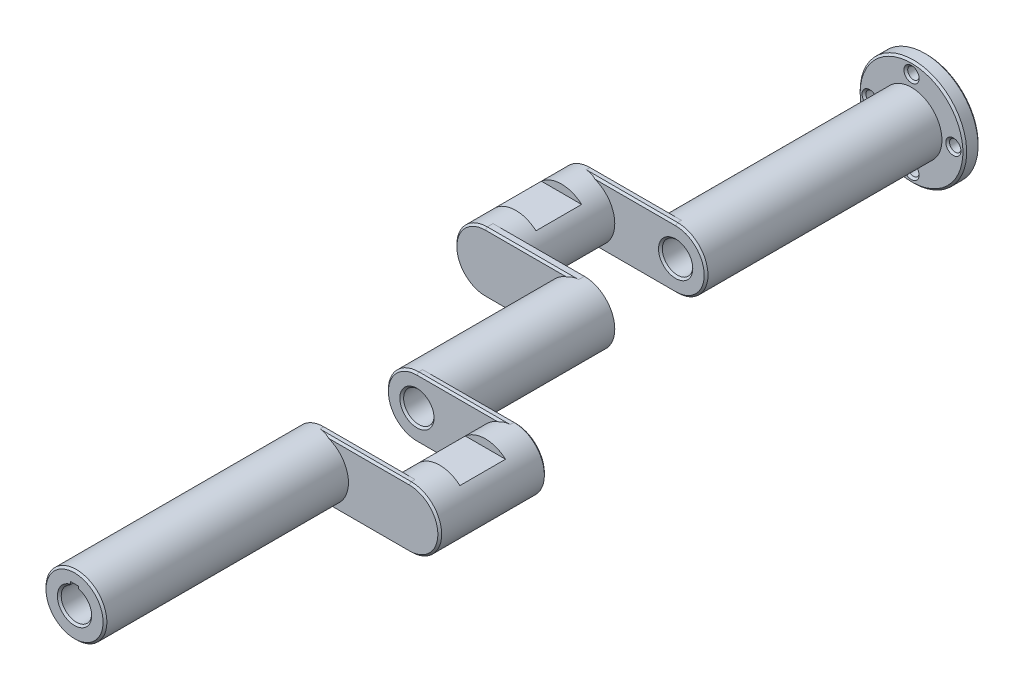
ISO-10303-21;
HEADER;
FILE_DESCRIPTION(('STEP AP214'),'2;1');
FILE_NAME('part.step','',(''),(''),'','','');
FILE_SCHEMA(('AUTOMOTIVE_DESIGN { 1 0 10303 214 1 1 1 1 }'));
ENDSEC;
DATA;
#1=APPLICATION_CONTEXT('core data for automotive mechanical design processes');
#2=APPLICATION_PROTOCOL_DEFINITION('international standard','automotive_design',2000,#1);
#3=PRODUCT_CONTEXT('',#1,'mechanical');
#4=PRODUCT('Part','Part','',(#3));
#5=PRODUCT_RELATED_PRODUCT_CATEGORY('part','',(#4));
#6=PRODUCT_DEFINITION_FORMATION('','',#4);
#7=PRODUCT_DEFINITION_CONTEXT('part definition',#1,'design');
#8=PRODUCT_DEFINITION('design','',#6,#7);
#9=PRODUCT_DEFINITION_SHAPE('','',#8);
#10=(LENGTH_UNIT() NAMED_UNIT(*) SI_UNIT(.MILLI.,.METRE.));
#11=(NAMED_UNIT(*) PLANE_ANGLE_UNIT() SI_UNIT($,.RADIAN.));
#12=(NAMED_UNIT(*) SI_UNIT($,.STERADIAN.) SOLID_ANGLE_UNIT());
#13=UNCERTAINTY_MEASURE_WITH_UNIT(LENGTH_MEASURE(1.E-05),#10,'distance_accuracy_value','');
#14=(GEOMETRIC_REPRESENTATION_CONTEXT(3) GLOBAL_UNCERTAINTY_ASSIGNED_CONTEXT((#13)) GLOBAL_UNIT_ASSIGNED_CONTEXT((#10,
#11,#12)) REPRESENTATION_CONTEXT('',''));
#15=CARTESIAN_POINT('',(0.,0.,0.));
#16=DIRECTION('',(0.,0.,1.));
#17=DIRECTION('',(1.,0.,0.));
#18=AXIS2_PLACEMENT_3D('',#15,#16,#17);
#19=CARTESIAN_POINT('',(0.,0.,-501.65));
#20=DIRECTION('',(0.,0.,-1.));
#21=DIRECTION('',(-1.,0.,0.));
#22=AXIS2_PLACEMENT_3D('',#19,#20,#21);
#23=CYLINDRICAL_SURFACE('',#22,25.4);
#24=DIRECTION('',(0.,0.,-1.));
#25=VECTOR('',#24,1.);
#26=CARTESIAN_POINT('',(0.,25.4,-501.65));
#27=LINE('',#26,#25);
#28=CARTESIAN_POINT('',(0.,25.4,-503.2375));
#29=VERTEX_POINT('',#28);
#30=CARTESIAN_POINT('',(0.,25.4,-506.4125));
#31=VERTEX_POINT('',#30);
#32=EDGE_CURVE('E389',#29,#31,#27,.T.);
#33=ORIENTED_EDGE('',*,*,#32,.F.);
#34=CARTESIAN_POINT('',(0.,0.,-503.2375));
#35=DIRECTION('',(0.,0.,1.));
#36=DIRECTION('',(1.,0.,0.));
#37=AXIS2_PLACEMENT_3D('',#34,#35,#36);
#38=CIRCLE('',#37,25.4);
#39=CARTESIAN_POINT('',(0.,-25.4,-503.2375));
#40=VERTEX_POINT('',#39);
#41=EDGE_CURVE('E1061',#29,#40,#38,.F.);
#42=ORIENTED_EDGE('',*,*,#41,.T.);
#43=DIRECTION('',(0.,0.,-1.));
#44=VECTOR('',#43,1.);
#45=CARTESIAN_POINT('',(0.,-25.4,-501.65));
#46=LINE('',#45,#44);
#47=CARTESIAN_POINT('',(0.,-25.4,-506.4125));
#48=VERTEX_POINT('',#47);
#49=EDGE_CURVE('E381',#40,#48,#46,.T.);
#50=ORIENTED_EDGE('',*,*,#49,.T.);
#51=CARTESIAN_POINT('',(0.,0.,-531.8125));
#52=DIRECTION('',(0.,-0.707106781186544,-0.707106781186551));
#53=DIRECTION('',(0.,0.707106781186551,-0.707106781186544));
#54=AXIS2_PLACEMENT_3D('',#51,#52,#53);
#55=ELLIPSE('',#54,35.9210244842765,25.4);
#56=CARTESIAN_POINT('',(-8.8388259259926,-23.8125,-508.));
#57=VERTEX_POINT('',#56);
#58=EDGE_CURVE('E936',#48,#57,#55,.T.);
#59=ORIENTED_EDGE('',*,*,#58,.T.);
#60=CARTESIAN_POINT('',(0.,0.,-508.));
#61=DIRECTION('',(0.,0.,-1.));
#62=DIRECTION('',(-1.,0.,0.));
#63=AXIS2_PLACEMENT_3D('',#60,#61,#62);
#64=CIRCLE('',#63,25.4);
#65=CARTESIAN_POINT('',(-8.8388259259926,23.8125,-508.));
#66=VERTEX_POINT('',#65);
#67=EDGE_CURVE('E1062',#57,#66,#64,.T.);
#68=ORIENTED_EDGE('',*,*,#67,.T.);
#69=CARTESIAN_POINT('',(0.,0.,-531.8125));
#70=DIRECTION('',(0.,0.707106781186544,-0.707106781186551));
#71=DIRECTION('',(0.,-0.707106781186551,-0.707106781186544));
#72=AXIS2_PLACEMENT_3D('',#69,#70,#71);
#73=ELLIPSE('',#72,35.9210244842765,25.4);
#74=EDGE_CURVE('E938',#66,#31,#73,.T.);
#75=ORIENTED_EDGE('',*,*,#74,.T.);
#76=EDGE_LOOP('',(#33,#42,#50,#59,#68,#75));
#77=FACE_BOUND('',#76,.T.);
#78=CARTESIAN_POINT('',(0.,0.,-698.5));
#79=DIRECTION('',(0.,0.,-1.));
#80=DIRECTION('',(-1.,0.,0.));
#81=AXIS2_PLACEMENT_3D('',#78,#79,#80);
#82=CIRCLE('',#81,25.4);
#83=CARTESIAN_POINT('',(-25.4,0.,-698.5));
#84=VERTEX_POINT('',#83);
#85=EDGE_CURVE('E554',#84,#84,#82,.T.);
#86=ORIENTED_EDGE('',*,*,#85,.F.);
#87=EDGE_LOOP('',(#86));
#88=FACE_BOUND('',#87,.T.);
#89=ADVANCED_FACE('F30',(#77,#88),#23,.T.);
#90=CARTESIAN_POINT('',(0.,0.,-508.));
#91=DIRECTION('',(0.,0.,1.));
#92=DIRECTION('',(-1.,0.,0.));
#93=AXIS2_PLACEMENT_3D('',#90,#91,#92);
#94=PLANE('',#93);
#95=ORIENTED_EDGE('',*,*,#67,.F.);
#96=DIRECTION('',(-1.,0.,0.));
#97=VECTOR('',#96,1.);
#98=CARTESIAN_POINT('',(-76.2,-23.8125,-508.));
#99=LINE('',#98,#97);
#100=CARTESIAN_POINT('',(-76.2,-23.8125,-508.));
#101=VERTEX_POINT('',#100);
#102=EDGE_CURVE('E1070',#57,#101,#99,.T.);
#103=ORIENTED_EDGE('',*,*,#102,.T.);
#104=CARTESIAN_POINT('',(-76.2,0.,-508.));
#105=DIRECTION('',(0.,0.,1.));
#106=DIRECTION('',(1.,0.,0.));
#107=AXIS2_PLACEMENT_3D('',#104,#105,#106);
#108=CIRCLE('',#107,23.8125);
#109=CARTESIAN_POINT('',(-76.2,23.8125,-508.));
#110=VERTEX_POINT('',#109);
#111=EDGE_CURVE('E1066',#101,#110,#108,.F.);
#112=ORIENTED_EDGE('',*,*,#111,.T.);
#113=DIRECTION('',(1.,0.,0.));
#114=VECTOR('',#113,1.);
#115=CARTESIAN_POINT('',(0.,23.8125,-508.));
#116=LINE('',#115,#114);
#117=EDGE_CURVE('E1068',#110,#66,#116,.T.);
#118=ORIENTED_EDGE('',*,*,#117,.T.);
#119=EDGE_LOOP('',(#95,#103,#112,#118));
#120=FACE_BOUND('',#119,.T.);
#121=ADVANCED_FACE('F626',(#120),#94,.F.);
#122=CARTESIAN_POINT('',(0.,0.,-292.1));
#123=DIRECTION('',(0.,0.,1.));
#124=DIRECTION('',(-1.,0.,0.));
#125=AXIS2_PLACEMENT_3D('',#122,#123,#124);
#126=PLANE('',#125);
#127=CARTESIAN_POINT('',(0.,0.,-292.1));
#128=DIRECTION('',(0.,0.,-1.));
#129=DIRECTION('',(-1.,0.,0.));
#130=AXIS2_PLACEMENT_3D('',#127,#128,#129);
#131=CIRCLE('',#130,25.4);
#132=CARTESIAN_POINT('',(8.83882592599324,23.8124999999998,-292.1));
#133=VERTEX_POINT('',#132);
#134=CARTESIAN_POINT('',(8.83882592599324,-23.8124999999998,-292.1));
#135=VERTEX_POINT('',#134);
#136=EDGE_CURVE('E494',#133,#135,#131,.T.);
#137=ORIENTED_EDGE('',*,*,#136,.F.);
#138=DIRECTION('',(1.,0.,0.));
#139=VECTOR('',#138,1.);
#140=CARTESIAN_POINT('',(76.2,23.8124999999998,-292.1));
#141=LINE('',#140,#139);
#142=CARTESIAN_POINT('',(76.2,23.8124999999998,-292.1));
#143=VERTEX_POINT('',#142);
#144=EDGE_CURVE('E474',#133,#143,#141,.T.);
#145=ORIENTED_EDGE('',*,*,#144,.T.);
#146=CARTESIAN_POINT('',(76.2,0.,-292.1));
#147=DIRECTION('',(0.,0.,1.));
#148=DIRECTION('',(1.,0.,0.));
#149=AXIS2_PLACEMENT_3D('',#146,#147,#148);
#150=CIRCLE('',#149,23.8124999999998);
#151=CARTESIAN_POINT('',(76.2,-23.8124999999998,-292.1));
#152=VERTEX_POINT('',#151);
#153=EDGE_CURVE('E505',#143,#152,#150,.F.);
#154=ORIENTED_EDGE('',*,*,#153,.T.);
#155=DIRECTION('',(-1.,0.,0.));
#156=VECTOR('',#155,1.);
#157=CARTESIAN_POINT('',(0.,-23.8124999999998,-292.1));
#158=LINE('',#157,#156);
#159=EDGE_CURVE('E510',#152,#135,#158,.T.);
#160=ORIENTED_EDGE('',*,*,#159,.T.);
#161=EDGE_LOOP('',(#137,#145,#154,#160));
#162=FACE_BOUND('',#161,.T.);
#163=ADVANCED_FACE('F515',(#162),#126,.F.);
#164=CARTESIAN_POINT('',(0.,0.,-203.2));
#165=DIRECTION('',(0.,0.,1.));
#166=DIRECTION('',(1.,0.,0.));
#167=AXIS2_PLACEMENT_3D('',#164,#165,#166);
#168=CYLINDRICAL_SURFACE('',#167,25.4);
#169=CARTESIAN_POINT('',(0.,0.,-1.58749999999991));
#170=DIRECTION('',(0.,0.,1.));
#171=DIRECTION('',(1.,0.,0.));
#172=AXIS2_PLACEMENT_3D('',#169,#170,#171);
#173=CIRCLE('',#172,25.4);
#174=CARTESIAN_POINT('',(-25.4,0.,-1.58749999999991));
#175=VERTEX_POINT('',#174);
#176=EDGE_CURVE('E1007',#175,#175,#173,.F.);
#177=ORIENTED_EDGE('',*,*,#176,.T.);
#178=EDGE_LOOP('',(#177));
#179=FACE_BOUND('',#178,.T.);
#180=DIRECTION('',(0.,0.,1.));
#181=VECTOR('',#180,1.);
#182=CARTESIAN_POINT('',(0.,25.4,-209.55));
#183=LINE('',#182,#181);
#184=CARTESIAN_POINT('',(0.,25.4,-207.9625));
#185=VERTEX_POINT('',#184);
#186=CARTESIAN_POINT('',(0.,25.4,-204.7875));
#187=VERTEX_POINT('',#186);
#188=EDGE_CURVE('E973',#185,#187,#183,.T.);
#189=ORIENTED_EDGE('',*,*,#188,.F.);
#190=CARTESIAN_POINT('',(0.,0.,-207.9625));
#191=DIRECTION('',(0.,0.,-1.));
#192=DIRECTION('',(-1.,0.,0.));
#193=AXIS2_PLACEMENT_3D('',#190,#191,#192);
#194=CIRCLE('',#193,25.4);
#195=CARTESIAN_POINT('',(0.,-25.4,-207.9625));
#196=VERTEX_POINT('',#195);
#197=EDGE_CURVE('E1009',#185,#196,#194,.F.);
#198=ORIENTED_EDGE('',*,*,#197,.T.);
#199=DIRECTION('',(0.,0.,1.));
#200=VECTOR('',#199,1.);
#201=CARTESIAN_POINT('',(0.,-25.4,-209.55));
#202=LINE('',#201,#200);
#203=CARTESIAN_POINT('',(0.,-25.4,-204.7875));
#204=VERTEX_POINT('',#203);
#205=EDGE_CURVE('E450',#196,#204,#202,.T.);
#206=ORIENTED_EDGE('',*,*,#205,.T.);
#207=CARTESIAN_POINT('',(0.,0.,-179.3875));
#208=DIRECTION('',(0.,0.707106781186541,-0.707106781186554));
#209=DIRECTION('',(0.,0.707106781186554,0.707106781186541));
#210=AXIS2_PLACEMENT_3D('',#207,#208,#209);
#211=ELLIPSE('',#210,35.9210244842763,25.4);
#212=CARTESIAN_POINT('',(8.83882592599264,-23.8125,-203.2));
#213=VERTEX_POINT('',#212);
#214=EDGE_CURVE('E949',#204,#213,#211,.F.);
#215=ORIENTED_EDGE('',*,*,#214,.T.);
#216=CARTESIAN_POINT('',(0.,0.,-203.2));
#217=DIRECTION('',(0.,0.,1.));
#218=DIRECTION('',(1.,0.,0.));
#219=AXIS2_PLACEMENT_3D('',#216,#217,#218);
#220=CIRCLE('',#219,25.4);
#221=CARTESIAN_POINT('',(8.83882592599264,23.8125,-203.2));
#222=VERTEX_POINT('',#221);
#223=EDGE_CURVE('E986',#213,#222,#220,.T.);
#224=ORIENTED_EDGE('',*,*,#223,.T.);
#225=CARTESIAN_POINT('',(0.,0.,-179.3875));
#226=DIRECTION('',(0.,-0.707106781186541,-0.707106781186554));
#227=DIRECTION('',(0.,-0.707106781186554,0.707106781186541));
#228=AXIS2_PLACEMENT_3D('',#225,#226,#227);
#229=ELLIPSE('',#228,35.9210244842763,25.4);
#230=EDGE_CURVE('E947',#222,#187,#229,.F.);
#231=ORIENTED_EDGE('',*,*,#230,.T.);
#232=EDGE_LOOP('',(#189,#198,#206,#215,#224,#231));
#233=FACE_BOUND('',#232,.T.);
#234=ADVANCED_FACE('F667',(#179,#233),#168,.T.);
#235=CARTESIAN_POINT('',(0.,0.,0.));
#236=DIRECTION('',(0.,0.,1.));
#237=DIRECTION('',(1.,0.,0.));
#238=AXIS2_PLACEMENT_3D('',#235,#236,#237);
#239=PLANE('',#238);
#240=CARTESIAN_POINT('',(0.,0.,0.));
#241=DIRECTION('',(0.,0.,1.));
#242=DIRECTION('',(1.,0.,0.));
#243=AXIS2_PLACEMENT_3D('',#240,#241,#242);
#244=CIRCLE('',#243,23.8125000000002);
#245=CARTESIAN_POINT('',(-23.8125000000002,0.,0.));
#246=VERTEX_POINT('',#245);
#247=EDGE_CURVE('E1806',#246,#246,#244,.T.);
#248=ORIENTED_EDGE('',*,*,#247,.T.);
#249=EDGE_LOOP('',(#248));
#250=FACE_BOUND('',#249,.T.);
#251=DIRECTION('',(0.,1.,0.));
#252=VECTOR('',#251,1.);
#253=CARTESIAN_POINT('',(3.175,12.2967221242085,0.));
#254=LINE('',#253,#252);
#255=CARTESIAN_POINT('',(3.175,14.5069681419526,0.));
#256=VERTEX_POINT('',#255);
#257=CARTESIAN_POINT('',(3.175,15.875,0.));
#258=VERTEX_POINT('',#257);
#259=EDGE_CURVE('E340',#256,#258,#254,.T.);
#260=ORIENTED_EDGE('',*,*,#259,.F.);
#261=DIRECTION('',(-0.507876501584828,0.86142989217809,0.));
#262=VECTOR('',#261,1.);
#263=CARTESIAN_POINT('',(8.70284369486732,5.13096869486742,0.));
#264=LINE('',#263,#262);
#265=CARTESIAN_POINT('',(3.57187499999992,13.8338123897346,0.));
#266=VERTEX_POINT('',#265);
#267=EDGE_CURVE('E1802',#256,#266,#264,.F.);
#268=ORIENTED_EDGE('',*,*,#267,.T.);
#269=CARTESIAN_POINT('',(0.,0.,0.));
#270=DIRECTION('',(0.,0.,1.));
#271=DIRECTION('',(1.,0.,0.));
#272=AXIS2_PLACEMENT_3D('',#269,#270,#271);
#273=CIRCLE('',#272,14.2875);
#274=CARTESIAN_POINT('',(-3.175,13.930255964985,0.));
#275=VERTEX_POINT('',#274);
#276=EDGE_CURVE('E1804',#266,#275,#273,.F.);
#277=ORIENTED_EDGE('',*,*,#276,.T.);
#278=DIRECTION('',(0.,-1.,0.));
#279=VECTOR('',#278,1.);
#280=CARTESIAN_POINT('',(-3.175,15.875,0.));
#281=LINE('',#280,#279);
#282=CARTESIAN_POINT('',(-3.175,15.875,0.));
#283=VERTEX_POINT('',#282);
#284=EDGE_CURVE('E334',#283,#275,#281,.T.);
#285=ORIENTED_EDGE('',*,*,#284,.F.);
#286=DIRECTION('',(-1.,0.,0.));
#287=VECTOR('',#286,1.);
#288=CARTESIAN_POINT('',(3.175,15.875,0.));
#289=LINE('',#288,#287);
#290=EDGE_CURVE('E353',#258,#283,#289,.T.);
#291=ORIENTED_EDGE('',*,*,#290,.F.);
#292=EDGE_LOOP('',(#260,#268,#277,#285,#291));
#293=FACE_BOUND('',#292,.T.);
#294=ADVANCED_FACE('F698',(#250,#293),#239,.T.);
#295=CARTESIAN_POINT('',(0.,25.4,-209.55));
#296=DIRECTION('',(0.,-1.,0.));
#297=DIRECTION('',(1.,0.,0.));
#298=AXIS2_PLACEMENT_3D('',#295,#296,#297);
#299=PLANE('',#298);
#300=ORIENTED_EDGE('',*,*,#188,.T.);
#301=DIRECTION('',(1.,0.,0.));
#302=VECTOR('',#301,1.);
#303=CARTESIAN_POINT('',(0.,25.4,-204.7875));
#304=LINE('',#303,#302);
#305=CARTESIAN_POINT('',(76.2,25.4,-204.7875));
#306=VERTEX_POINT('',#305);
#307=EDGE_CURVE('E972',#187,#306,#304,.T.);
#308=ORIENTED_EDGE('',*,*,#307,.T.);
#309=DIRECTION('',(0.,0.,1.));
#310=VECTOR('',#309,1.);
#311=CARTESIAN_POINT('',(76.2,25.4,-209.55));
#312=LINE('',#311,#310);
#313=CARTESIAN_POINT('',(76.2,25.4,-207.9625));
#314=VERTEX_POINT('',#313);
#315=EDGE_CURVE('E962',#314,#306,#312,.T.);
#316=ORIENTED_EDGE('',*,*,#315,.F.);
#317=DIRECTION('',(-1.,0.,0.));
#318=VECTOR('',#317,1.);
#319=CARTESIAN_POINT('',(0.,25.4,-207.9625));
#320=LINE('',#319,#318);
#321=EDGE_CURVE('E969',#314,#185,#320,.T.);
#322=ORIENTED_EDGE('',*,*,#321,.T.);
#323=EDGE_LOOP('',(#300,#308,#316,#322));
#324=FACE_BOUND('',#323,.T.);
#325=ADVANCED_FACE('F694',(#324),#299,.F.);
#326=CARTESIAN_POINT('',(76.2,0.,-209.55));
#327=DIRECTION('',(0.,0.,1.));
#328=DIRECTION('',(1.,0.,0.));
#329=AXIS2_PLACEMENT_3D('',#326,#327,#328);
#330=CYLINDRICAL_SURFACE('',#329,25.4);
#331=DIRECTION('',(0.,0.,1.));
#332=VECTOR('',#331,1.);
#333=CARTESIAN_POINT('',(59.3994791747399,-19.05,-209.55));
#334=LINE('',#333,#332);
#335=CARTESIAN_POINT('',(59.3994791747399,-19.05,-266.7));
#336=VERTEX_POINT('',#335);
#337=CARTESIAN_POINT('',(59.3994791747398,-19.05,-228.6));
#338=VERTEX_POINT('',#337);
#339=EDGE_CURVE('E1921',#336,#338,#334,.T.);
#340=ORIENTED_EDGE('',*,*,#339,.T.);
#341=CARTESIAN_POINT('',(76.2,0.,-228.6));
#342=DIRECTION('',(0.,0.,1.));
#343=DIRECTION('',(1.,0.,0.));
#344=AXIS2_PLACEMENT_3D('',#341,#342,#343);
#345=CIRCLE('',#344,25.4);
#346=CARTESIAN_POINT('',(93.0005208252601,-19.05,-228.6));
#347=VERTEX_POINT('',#346);
#348=EDGE_CURVE('E1918',#338,#347,#345,.T.);
#349=ORIENTED_EDGE('',*,*,#348,.T.);
#350=DIRECTION('',(0.,0.,1.));
#351=VECTOR('',#350,1.);
#352=CARTESIAN_POINT('',(93.0005208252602,-19.05,-209.55));
#353=LINE('',#352,#351);
#354=CARTESIAN_POINT('',(93.0005208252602,-19.05,-266.7));
#355=VERTEX_POINT('',#354);
#356=EDGE_CURVE('E1924',#347,#355,#353,.F.);
#357=ORIENTED_EDGE('',*,*,#356,.T.);
#358=CARTESIAN_POINT('',(76.2,0.,-266.7));
#359=DIRECTION('',(0.,0.,-1.));
#360=DIRECTION('',(-1.,0.,0.));
#361=AXIS2_PLACEMENT_3D('',#358,#359,#360);
#362=CIRCLE('',#361,25.4);
#363=EDGE_CURVE('E1927',#355,#336,#362,.T.);
#364=ORIENTED_EDGE('',*,*,#363,.T.);
#365=EDGE_LOOP('',(#340,#349,#357,#364));
#366=FACE_BOUND('',#365,.T.);
#367=CARTESIAN_POINT('',(76.2,0.,-266.7));
#368=DIRECTION('',(0.,0.,-1.));
#369=DIRECTION('',(-1.,0.,0.));
#370=AXIS2_PLACEMENT_3D('',#367,#368,#369);
#371=CIRCLE('',#370,25.4);
#372=CARTESIAN_POINT('',(59.3994791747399,19.05,-266.7));
#373=VERTEX_POINT('',#372);
#374=CARTESIAN_POINT('',(93.0005208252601,19.05,-266.7));
#375=VERTEX_POINT('',#374);
#376=EDGE_CURVE('E1935',#373,#375,#371,.T.);
#377=ORIENTED_EDGE('',*,*,#376,.T.);
#378=DIRECTION('',(0.,0.,1.));
#379=VECTOR('',#378,1.);
#380=CARTESIAN_POINT('',(93.0005208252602,19.05,-209.55));
#381=LINE('',#380,#379);
#382=CARTESIAN_POINT('',(93.0005208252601,19.05,-228.6));
#383=VERTEX_POINT('',#382);
#384=EDGE_CURVE('E1930',#375,#383,#381,.T.);
#385=ORIENTED_EDGE('',*,*,#384,.T.);
#386=CARTESIAN_POINT('',(76.2,0.,-228.6));
#387=DIRECTION('',(0.,0.,1.));
#388=DIRECTION('',(1.,0.,0.));
#389=AXIS2_PLACEMENT_3D('',#386,#387,#388);
#390=CIRCLE('',#389,25.4);
#391=CARTESIAN_POINT('',(59.3994791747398,19.05,-228.6));
#392=VERTEX_POINT('',#391);
#393=EDGE_CURVE('E1933',#383,#392,#390,.T.);
#394=ORIENTED_EDGE('',*,*,#393,.T.);
#395=DIRECTION('',(0.,0.,1.));
#396=VECTOR('',#395,1.);
#397=CARTESIAN_POINT('',(59.3994791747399,19.05,-209.55));
#398=LINE('',#397,#396);
#399=EDGE_CURVE('E1048',#392,#373,#398,.F.);
#400=ORIENTED_EDGE('',*,*,#399,.T.);
#401=EDGE_LOOP('',(#377,#385,#394,#400));
#402=FACE_BOUND('',#401,.T.);
#403=ORIENTED_EDGE('',*,*,#315,.T.);
#404=CARTESIAN_POINT('',(76.2,0.,-204.7875));
#405=DIRECTION('',(0.,0.,-1.));
#406=DIRECTION('',(-1.,0.,0.));
#407=AXIS2_PLACEMENT_3D('',#404,#405,#406);
#408=CIRCLE('',#407,25.4);
#409=CARTESIAN_POINT('',(76.2,-25.4,-204.7875));
#410=VERTEX_POINT('',#409);
#411=EDGE_CURVE('E981',#306,#410,#408,.T.);
#412=ORIENTED_EDGE('',*,*,#411,.T.);
#413=DIRECTION('',(0.,0.,1.));
#414=VECTOR('',#413,1.);
#415=CARTESIAN_POINT('',(76.2,-25.4,-209.55));
#416=LINE('',#415,#414);
#417=CARTESIAN_POINT('',(76.2,-25.4,-207.9625));
#418=VERTEX_POINT('',#417);
#419=EDGE_CURVE('E974',#418,#410,#416,.T.);
#420=ORIENTED_EDGE('',*,*,#419,.F.);
#421=CARTESIAN_POINT('',(76.2,0.,-233.362500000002));
#422=DIRECTION('',(0.,-0.70710678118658,-0.707106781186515));
#423=DIRECTION('',(0.,-0.707106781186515,0.70710678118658));
#424=AXIS2_PLACEMENT_3D('',#421,#422,#423);
#425=ELLIPSE('',#424,35.9210244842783,25.4);
#426=CARTESIAN_POINT('',(67.361174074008,-23.8125000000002,-209.55));
#427=VERTEX_POINT('',#426);
#428=EDGE_CURVE('E955',#418,#427,#425,.T.);
#429=ORIENTED_EDGE('',*,*,#428,.T.);
#430=CARTESIAN_POINT('',(76.2,0.,-209.55));
#431=DIRECTION('',(0.,0.,-1.));
#432=DIRECTION('',(-1.,0.,0.));
#433=AXIS2_PLACEMENT_3D('',#430,#431,#432);
#434=CIRCLE('',#433,25.4);
#435=CARTESIAN_POINT('',(67.361174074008,23.8125000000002,-209.55));
#436=VERTEX_POINT('',#435);
#437=EDGE_CURVE('E964',#427,#436,#434,.T.);
#438=ORIENTED_EDGE('',*,*,#437,.T.);
#439=CARTESIAN_POINT('',(76.2,0.,-233.362500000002));
#440=DIRECTION('',(0.,0.70710678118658,-0.707106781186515));
#441=DIRECTION('',(0.,0.707106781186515,0.70710678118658));
#442=AXIS2_PLACEMENT_3D('',#439,#440,#441);
#443=ELLIPSE('',#442,35.9210244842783,25.4);
#444=EDGE_CURVE('E561',#436,#314,#443,.T.);
#445=ORIENTED_EDGE('',*,*,#444,.T.);
#446=EDGE_LOOP('',(#403,#412,#420,#429,#438,#445));
#447=FACE_BOUND('',#446,.T.);
#448=DIRECTION('',(0.,0.,-1.));
#449=VECTOR('',#448,1.);
#450=CARTESIAN_POINT('',(76.2,-25.4,-285.75));
#451=LINE('',#450,#449);
#452=CARTESIAN_POINT('',(76.2,-25.4,-287.3375));
#453=VERTEX_POINT('',#452);
#454=CARTESIAN_POINT('',(76.2,-25.4,-290.5125));
#455=VERTEX_POINT('',#454);
#456=EDGE_CURVE('E467',#453,#455,#451,.T.);
#457=ORIENTED_EDGE('',*,*,#456,.T.);
#458=CARTESIAN_POINT('',(76.2,0.,-290.5125));
#459=DIRECTION('',(0.,0.,1.));
#460=DIRECTION('',(1.,0.,0.));
#461=AXIS2_PLACEMENT_3D('',#458,#459,#460);
#462=CIRCLE('',#461,25.4);
#463=CARTESIAN_POINT('',(76.2,25.4,-290.5125));
#464=VERTEX_POINT('',#463);
#465=EDGE_CURVE('E533',#455,#464,#462,.T.);
#466=ORIENTED_EDGE('',*,*,#465,.T.);
#467=DIRECTION('',(0.,0.,-1.));
#468=VECTOR('',#467,1.);
#469=CARTESIAN_POINT('',(76.2,25.4,-285.75));
#470=LINE('',#469,#468);
#471=CARTESIAN_POINT('',(76.2,25.4,-287.3375));
#472=VERTEX_POINT('',#471);
#473=EDGE_CURVE('E463',#472,#464,#470,.T.);
#474=ORIENTED_EDGE('',*,*,#473,.F.);
#475=CARTESIAN_POINT('',(76.2,0.,-261.937499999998));
#476=DIRECTION('',(0.,-0.707106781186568,-0.707106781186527));
#477=DIRECTION('',(0.,-0.707106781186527,0.707106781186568));
#478=AXIS2_PLACEMENT_3D('',#475,#476,#477);
#479=ELLIPSE('',#478,35.9210244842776,25.4);
#480=CARTESIAN_POINT('',(67.3611740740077,23.8125000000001,-285.75));
#481=VERTEX_POINT('',#480);
#482=EDGE_CURVE('E953',#472,#481,#479,.F.);
#483=ORIENTED_EDGE('',*,*,#482,.T.);
#484=CARTESIAN_POINT('',(76.2,0.,-285.75));
#485=DIRECTION('',(0.,0.,-1.));
#486=DIRECTION('',(-1.,0.,0.));
#487=AXIS2_PLACEMENT_3D('',#484,#485,#486);
#488=CIRCLE('',#487,25.4);
#489=CARTESIAN_POINT('',(67.3611740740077,-23.8125000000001,-285.75));
#490=VERTEX_POINT('',#489);
#491=EDGE_CURVE('E446',#490,#481,#488,.T.);
#492=ORIENTED_EDGE('',*,*,#491,.F.);
#493=CARTESIAN_POINT('',(76.2,0.,-261.937499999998));
#494=DIRECTION('',(0.,0.707106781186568,-0.707106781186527));
#495=DIRECTION('',(0.,0.707106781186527,0.707106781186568));
#496=AXIS2_PLACEMENT_3D('',#493,#494,#495);
#497=ELLIPSE('',#496,35.9210244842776,25.4);
#498=EDGE_CURVE('E951',#490,#453,#497,.F.);
#499=ORIENTED_EDGE('',*,*,#498,.T.);
#500=EDGE_LOOP('',(#457,#466,#474,#483,#492,#499));
#501=FACE_BOUND('',#500,.T.);
#502=ADVANCED_FACE('F690',(#366,#402,#447,#501),#330,.T.);
#503=CARTESIAN_POINT('',(0.,-25.4,-209.55));
#504=DIRECTION('',(0.,1.,0.));
#505=DIRECTION('',(-1.,0.,0.));
#506=AXIS2_PLACEMENT_3D('',#503,#504,#505);
#507=PLANE('',#506);
#508=ORIENTED_EDGE('',*,*,#419,.T.);
#509=DIRECTION('',(-1.,0.,0.));
#510=VECTOR('',#509,1.);
#511=CARTESIAN_POINT('',(0.,-25.4,-204.7875));
#512=LINE('',#511,#510);
#513=EDGE_CURVE('E1003',#410,#204,#512,.T.);
#514=ORIENTED_EDGE('',*,*,#513,.T.);
#515=ORIENTED_EDGE('',*,*,#205,.F.);
#516=DIRECTION('',(1.,0.,0.));
#517=VECTOR('',#516,1.);
#518=CARTESIAN_POINT('',(76.2,-25.4,-207.9625));
#519=LINE('',#518,#517);
#520=EDGE_CURVE('E1001',#196,#418,#519,.T.);
#521=ORIENTED_EDGE('',*,*,#520,.T.);
#522=EDGE_LOOP('',(#508,#514,#515,#521));
#523=FACE_BOUND('',#522,.T.);
#524=ADVANCED_FACE('F683',(#523),#507,.F.);
#525=CARTESIAN_POINT('',(0.,0.,-209.55));
#526=DIRECTION('',(0.,0.,-1.));
#527=DIRECTION('',(-1.,0.,0.));
#528=AXIS2_PLACEMENT_3D('',#525,#526,#527);
#529=PLANE('',#528);
#530=CARTESIAN_POINT('',(0.,0.,-209.55));
#531=DIRECTION('',(0.,0.,-1.));
#532=DIRECTION('',(-1.,0.,0.));
#533=AXIS2_PLACEMENT_3D('',#530,#531,#532);
#534=CIRCLE('',#533,14.2875);
#535=CARTESIAN_POINT('',(-14.2875,0.,-209.55));
#536=VERTEX_POINT('',#535);
#537=EDGE_CURVE('E1027',#536,#536,#534,.F.);
#538=ORIENTED_EDGE('',*,*,#537,.T.);
#539=EDGE_LOOP('',(#538));
#540=FACE_BOUND('',#539,.T.);
#541=ORIENTED_EDGE('',*,*,#437,.F.);
#542=DIRECTION('',(-1.,0.,0.));
#543=VECTOR('',#542,1.);
#544=CARTESIAN_POINT('',(0.,-23.8125000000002,-209.55));
#545=LINE('',#544,#543);
#546=CARTESIAN_POINT('',(0.,-23.8125000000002,-209.55));
#547=VERTEX_POINT('',#546);
#548=EDGE_CURVE('E1026',#427,#547,#545,.T.);
#549=ORIENTED_EDGE('',*,*,#548,.T.);
#550=CARTESIAN_POINT('',(0.,0.,-209.55));
#551=DIRECTION('',(0.,0.,-1.));
#552=DIRECTION('',(-1.,0.,0.));
#553=AXIS2_PLACEMENT_3D('',#550,#551,#552);
#554=CIRCLE('',#553,23.8125000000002);
#555=CARTESIAN_POINT('',(0.,23.8125000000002,-209.55));
#556=VERTEX_POINT('',#555);
#557=EDGE_CURVE('E1021',#547,#556,#554,.T.);
#558=ORIENTED_EDGE('',*,*,#557,.T.);
#559=DIRECTION('',(1.,0.,0.));
#560=VECTOR('',#559,1.);
#561=CARTESIAN_POINT('',(76.2,23.8125000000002,-209.55));
#562=LINE('',#561,#560);
#563=EDGE_CURVE('E1024',#556,#436,#562,.T.);
#564=ORIENTED_EDGE('',*,*,#563,.T.);
#565=EDGE_LOOP('',(#541,#549,#558,#564));
#566=FACE_BOUND('',#565,.T.);
#567=ADVANCED_FACE('F680',(#540,#566),#529,.T.);
#568=CARTESIAN_POINT('',(0.,0.,-203.2));
#569=DIRECTION('',(0.,0.,-1.));
#570=DIRECTION('',(-1.,0.,0.));
#571=AXIS2_PLACEMENT_3D('',#568,#569,#570);
#572=PLANE('',#571);
#573=CARTESIAN_POINT('',(76.2,0.,-203.2));
#574=DIRECTION('',(0.,0.,-1.));
#575=DIRECTION('',(-1.,0.,0.));
#576=AXIS2_PLACEMENT_3D('',#573,#574,#575);
#577=CIRCLE('',#576,23.8125);
#578=CARTESIAN_POINT('',(76.2,-23.8125,-203.2));
#579=VERTEX_POINT('',#578);
#580=CARTESIAN_POINT('',(76.2,23.8125,-203.2));
#581=VERTEX_POINT('',#580);
#582=EDGE_CURVE('E979',#579,#581,#577,.F.);
#583=ORIENTED_EDGE('',*,*,#582,.T.);
#584=DIRECTION('',(-1.,0.,0.));
#585=VECTOR('',#584,1.);
#586=CARTESIAN_POINT('',(0.,23.8125,-203.2));
#587=LINE('',#586,#585);
#588=EDGE_CURVE('E1000',#581,#222,#587,.T.);
#589=ORIENTED_EDGE('',*,*,#588,.T.);
#590=ORIENTED_EDGE('',*,*,#223,.F.);
#591=DIRECTION('',(1.,0.,0.));
#592=VECTOR('',#591,1.);
#593=CARTESIAN_POINT('',(0.,-23.8125,-203.2));
#594=LINE('',#593,#592);
#595=EDGE_CURVE('E1842',#213,#579,#594,.T.);
#596=ORIENTED_EDGE('',*,*,#595,.T.);
#597=EDGE_LOOP('',(#583,#589,#590,#596));
#598=FACE_BOUND('',#597,.T.);
#599=ADVANCED_FACE('F678',(#598),#572,.F.);
#600=CARTESIAN_POINT('',(0.,0.,-285.75));
#601=DIRECTION('',(0.,0.,-1.));
#602=DIRECTION('',(-1.,0.,0.));
#603=AXIS2_PLACEMENT_3D('',#600,#601,#602);
#604=CYLINDRICAL_SURFACE('',#603,25.4);
#605=DIRECTION('',(0.,0.,-1.));
#606=VECTOR('',#605,1.);
#607=CARTESIAN_POINT('',(0.,-25.4,-285.75));
#608=LINE('',#607,#606);
#609=CARTESIAN_POINT('',(0.,-25.4,-287.3375));
#610=VERTEX_POINT('',#609);
#611=CARTESIAN_POINT('',(0.,-25.4,-290.5125));
#612=VERTEX_POINT('',#611);
#613=EDGE_CURVE('E451',#610,#612,#608,.T.);
#614=ORIENTED_EDGE('',*,*,#613,.F.);
#615=CARTESIAN_POINT('',(0.,0.,-287.3375));
#616=DIRECTION('',(0.,0.,1.));
#617=DIRECTION('',(1.,0.,0.));
#618=AXIS2_PLACEMENT_3D('',#615,#616,#617);
#619=CIRCLE('',#618,25.4);
#620=CARTESIAN_POINT('',(0.,25.4,-287.3375));
#621=VERTEX_POINT('',#620);
#622=EDGE_CURVE('E1005',#610,#621,#619,.F.);
#623=ORIENTED_EDGE('',*,*,#622,.T.);
#624=DIRECTION('',(0.,0.,-1.));
#625=VECTOR('',#624,1.);
#626=CARTESIAN_POINT('',(0.,25.4,-285.75));
#627=LINE('',#626,#625);
#628=CARTESIAN_POINT('',(0.,25.4,-290.5125));
#629=VERTEX_POINT('',#628);
#630=EDGE_CURVE('E468',#621,#629,#627,.T.);
#631=ORIENTED_EDGE('',*,*,#630,.T.);
#632=CARTESIAN_POINT('',(0.,0.,-315.912499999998));
#633=DIRECTION('',(0.,0.707106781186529,-0.707106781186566));
#634=DIRECTION('',(0.,-0.707106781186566,-0.707106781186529));
#635=AXIS2_PLACEMENT_3D('',#632,#633,#634);
#636=ELLIPSE('',#635,35.9210244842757,25.4);
#637=EDGE_CURVE('E522',#629,#133,#636,.T.);
#638=ORIENTED_EDGE('',*,*,#637,.T.);
#639=ORIENTED_EDGE('',*,*,#136,.T.);
#640=CARTESIAN_POINT('',(0.,0.,-315.912499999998));
#641=DIRECTION('',(0.,-0.707106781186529,-0.707106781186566));
#642=DIRECTION('',(0.,0.707106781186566,-0.707106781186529));
#643=AXIS2_PLACEMENT_3D('',#640,#641,#642);
#644=ELLIPSE('',#643,35.9210244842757,25.4);
#645=EDGE_CURVE('E945',#135,#612,#644,.T.);
#646=ORIENTED_EDGE('',*,*,#645,.T.);
#647=EDGE_LOOP('',(#614,#623,#631,#638,#639,#646));
#648=FACE_BOUND('',#647,.T.);
#649=CARTESIAN_POINT('',(0.,0.,-419.1));
#650=DIRECTION('',(0.,0.,-1.));
#651=DIRECTION('',(-1.,0.,0.));
#652=AXIS2_PLACEMENT_3D('',#649,#650,#651);
#653=CIRCLE('',#652,25.4);
#654=CARTESIAN_POINT('',(-8.83882592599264,-23.8125,-419.1));
#655=VERTEX_POINT('',#654);
#656=CARTESIAN_POINT('',(-8.83882592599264,23.8125,-419.1));
#657=VERTEX_POINT('',#656);
#658=EDGE_CURVE('E490',#655,#657,#653,.T.);
#659=ORIENTED_EDGE('',*,*,#658,.F.);
#660=CARTESIAN_POINT('',(0.,0.,-395.2875));
#661=DIRECTION('',(0.,0.707106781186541,-0.707106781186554));
#662=DIRECTION('',(0.,-0.707106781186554,-0.707106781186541));
#663=AXIS2_PLACEMENT_3D('',#660,#661,#662);
#664=ELLIPSE('',#663,35.9210244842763,25.4);
#665=CARTESIAN_POINT('',(0.,-25.4,-420.6875));
#666=VERTEX_POINT('',#665);
#667=EDGE_CURVE('E940',#655,#666,#664,.F.);
#668=ORIENTED_EDGE('',*,*,#667,.T.);
#669=DIRECTION('',(0.,0.,1.));
#670=VECTOR('',#669,1.);
#671=CARTESIAN_POINT('',(0.,-25.4,-425.45));
#672=LINE('',#671,#670);
#673=CARTESIAN_POINT('',(0.,-25.4,-425.45));
#674=VERTEX_POINT('',#673);
#675=EDGE_CURVE('E414',#674,#666,#672,.T.);
#676=ORIENTED_EDGE('',*,*,#675,.F.);
#677=CARTESIAN_POINT('',(0.,0.,-425.45));
#678=DIRECTION('',(0.,0.,-1.));
#679=DIRECTION('',(-1.,0.,0.));
#680=AXIS2_PLACEMENT_3D('',#677,#678,#679);
#681=CIRCLE('',#680,25.4);
#682=CARTESIAN_POINT('',(0.,25.4,-425.45));
#683=VERTEX_POINT('',#682);
#684=EDGE_CURVE('E390',#683,#674,#681,.T.);
#685=ORIENTED_EDGE('',*,*,#684,.F.);
#686=DIRECTION('',(0.,0.,1.));
#687=VECTOR('',#686,1.);
#688=CARTESIAN_POINT('',(0.,25.4,-425.45));
#689=LINE('',#688,#687);
#690=CARTESIAN_POINT('',(0.,25.4,-420.6875));
#691=VERTEX_POINT('',#690);
#692=EDGE_CURVE('E399',#683,#691,#689,.T.);
#693=ORIENTED_EDGE('',*,*,#692,.T.);
#694=CARTESIAN_POINT('',(0.,0.,-395.2875));
#695=DIRECTION('',(0.,-0.707106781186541,-0.707106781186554));
#696=DIRECTION('',(0.,0.707106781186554,-0.707106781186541));
#697=AXIS2_PLACEMENT_3D('',#694,#695,#696);
#698=ELLIPSE('',#697,35.9210244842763,25.4);
#699=EDGE_CURVE('E942',#691,#657,#698,.F.);
#700=ORIENTED_EDGE('',*,*,#699,.T.);
#701=EDGE_LOOP('',(#659,#668,#676,#685,#693,#700));
#702=FACE_BOUND('',#701,.T.);
#703=ADVANCED_FACE('F674',(#648,#702),#604,.T.);
#704=CARTESIAN_POINT('',(0.,-25.4,-285.75));
#705=DIRECTION('',(0.,-1.,0.));
#706=DIRECTION('',(1.,0.,0.));
#707=AXIS2_PLACEMENT_3D('',#704,#705,#706);
#708=PLANE('',#707);
#709=ORIENTED_EDGE('',*,*,#613,.T.);
#710=DIRECTION('',(1.,0.,0.));
#711=VECTOR('',#710,1.);
#712=CARTESIAN_POINT('',(76.2,-25.4,-290.5125));
#713=LINE('',#712,#711);
#714=EDGE_CURVE('E1831',#612,#455,#713,.T.);
#715=ORIENTED_EDGE('',*,*,#714,.T.);
#716=ORIENTED_EDGE('',*,*,#456,.F.);
#717=DIRECTION('',(-1.,0.,0.));
#718=VECTOR('',#717,1.);
#719=CARTESIAN_POINT('',(0.,-25.4,-287.3375));
#720=LINE('',#719,#718);
#721=EDGE_CURVE('E476',#453,#610,#720,.T.);
#722=ORIENTED_EDGE('',*,*,#721,.T.);
#723=EDGE_LOOP('',(#709,#715,#716,#722));
#724=FACE_BOUND('',#723,.T.);
#725=ADVANCED_FACE('F670',(#724),#708,.T.);
#726=CARTESIAN_POINT('',(0.,25.4,-285.75));
#727=DIRECTION('',(0.,1.,0.));
#728=DIRECTION('',(-1.,0.,0.));
#729=AXIS2_PLACEMENT_3D('',#726,#727,#728);
#730=PLANE('',#729);
#731=ORIENTED_EDGE('',*,*,#473,.T.);
#732=DIRECTION('',(-1.,0.,0.));
#733=VECTOR('',#732,1.);
#734=CARTESIAN_POINT('',(0.,25.4,-290.5125));
#735=LINE('',#734,#733);
#736=EDGE_CURVE('E473',#464,#629,#735,.T.);
#737=ORIENTED_EDGE('',*,*,#736,.T.);
#738=ORIENTED_EDGE('',*,*,#630,.F.);
#739=DIRECTION('',(1.,0.,0.));
#740=VECTOR('',#739,1.);
#741=CARTESIAN_POINT('',(0.,25.4,-287.3375));
#742=LINE('',#741,#740);
#743=EDGE_CURVE('E471',#621,#472,#742,.T.);
#744=ORIENTED_EDGE('',*,*,#743,.T.);
#745=EDGE_LOOP('',(#731,#737,#738,#744));
#746=FACE_BOUND('',#745,.T.);
#747=ADVANCED_FACE('F663',(#746),#730,.T.);
#748=CARTESIAN_POINT('',(0.,0.,-285.75));
#749=DIRECTION('',(0.,0.,1.));
#750=DIRECTION('',(-1.,0.,0.));
#751=AXIS2_PLACEMENT_3D('',#748,#749,#750);
#752=PLANE('',#751);
#753=CARTESIAN_POINT('',(0.,0.,-285.75));
#754=DIRECTION('',(0.,0.,1.));
#755=DIRECTION('',(1.,0.,0.));
#756=AXIS2_PLACEMENT_3D('',#753,#754,#755);
#757=CIRCLE('',#756,14.2875);
#758=CARTESIAN_POINT('',(14.2875,0.,-285.75));
#759=VERTEX_POINT('',#758);
#760=EDGE_CURVE('E1811',#759,#759,#757,.F.);
#761=ORIENTED_EDGE('',*,*,#760,.T.);
#762=EDGE_LOOP('',(#761));
#763=FACE_BOUND('',#762,.T.);
#764=CARTESIAN_POINT('',(0.,0.,-285.75));
#765=DIRECTION('',(0.,0.,1.));
#766=DIRECTION('',(1.,0.,0.));
#767=AXIS2_PLACEMENT_3D('',#764,#765,#766);
#768=CIRCLE('',#767,23.8125000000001);
#769=CARTESIAN_POINT('',(0.,23.8125000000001,-285.75));
#770=VERTEX_POINT('',#769);
#771=CARTESIAN_POINT('',(0.,-23.8125000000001,-285.75));
#772=VERTEX_POINT('',#771);
#773=EDGE_CURVE('E445',#770,#772,#768,.T.);
#774=ORIENTED_EDGE('',*,*,#773,.T.);
#775=DIRECTION('',(1.,0.,0.));
#776=VECTOR('',#775,1.);
#777=CARTESIAN_POINT('',(0.,-23.8125000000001,-285.75));
#778=LINE('',#777,#776);
#779=EDGE_CURVE('E1814',#772,#490,#778,.T.);
#780=ORIENTED_EDGE('',*,*,#779,.T.);
#781=ORIENTED_EDGE('',*,*,#491,.T.);
#782=DIRECTION('',(-1.,0.,0.));
#783=VECTOR('',#782,1.);
#784=CARTESIAN_POINT('',(0.,23.8125000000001,-285.75));
#785=LINE('',#784,#783);
#786=EDGE_CURVE('E1815',#481,#770,#785,.T.);
#787=ORIENTED_EDGE('',*,*,#786,.T.);
#788=EDGE_LOOP('',(#774,#780,#781,#787));
#789=FACE_BOUND('',#788,.T.);
#790=ADVANCED_FACE('F649',(#763,#789),#752,.T.);
#791=CARTESIAN_POINT('',(0.,0.,-419.1));
#792=DIRECTION('',(0.,0.,-1.));
#793=DIRECTION('',(-1.,0.,0.));
#794=AXIS2_PLACEMENT_3D('',#791,#792,#793);
#795=PLANE('',#794);
#796=CARTESIAN_POINT('',(-76.2,0.,-419.1));
#797=DIRECTION('',(0.,0.,-1.));
#798=DIRECTION('',(-1.,0.,0.));
#799=AXIS2_PLACEMENT_3D('',#796,#797,#798);
#800=CIRCLE('',#799,23.8125);
#801=CARTESIAN_POINT('',(-76.2,23.8125,-419.1));
#802=VERTEX_POINT('',#801);
#803=CARTESIAN_POINT('',(-76.2,-23.8125,-419.1));
#804=VERTEX_POINT('',#803);
#805=EDGE_CURVE('E497',#802,#804,#800,.F.);
#806=ORIENTED_EDGE('',*,*,#805,.T.);
#807=DIRECTION('',(1.,0.,0.));
#808=VECTOR('',#807,1.);
#809=CARTESIAN_POINT('',(0.,-23.8125,-419.1));
#810=LINE('',#809,#808);
#811=EDGE_CURVE('E501',#804,#655,#810,.T.);
#812=ORIENTED_EDGE('',*,*,#811,.T.);
#813=ORIENTED_EDGE('',*,*,#658,.T.);
#814=DIRECTION('',(-1.,0.,0.));
#815=VECTOR('',#814,1.);
#816=CARTESIAN_POINT('',(0.,23.8125,-419.1));
#817=LINE('',#816,#815);
#818=EDGE_CURVE('E499',#657,#802,#817,.T.);
#819=ORIENTED_EDGE('',*,*,#818,.T.);
#820=EDGE_LOOP('',(#806,#812,#813,#819));
#821=FACE_BOUND('',#820,.T.);
#822=ADVANCED_FACE('F645',(#821),#795,.F.);
#823=CARTESIAN_POINT('',(0.,-25.4,-425.45));
#824=DIRECTION('',(0.,1.,0.));
#825=DIRECTION('',(0.,0.,1.));
#826=AXIS2_PLACEMENT_3D('',#823,#824,#825);
#827=PLANE('',#826);
#828=ORIENTED_EDGE('',*,*,#675,.T.);
#829=DIRECTION('',(-1.,0.,0.));
#830=VECTOR('',#829,1.);
#831=CARTESIAN_POINT('',(0.,-25.4,-420.6875));
#832=LINE('',#831,#830);
#833=CARTESIAN_POINT('',(-76.2,-25.4,-420.6875));
#834=VERTEX_POINT('',#833);
#835=EDGE_CURVE('E495',#666,#834,#832,.T.);
#836=ORIENTED_EDGE('',*,*,#835,.T.);
#837=DIRECTION('',(0.,0.,1.));
#838=VECTOR('',#837,1.);
#839=CARTESIAN_POINT('',(-76.2,-25.4,-425.45));
#840=LINE('',#839,#838);
#841=CARTESIAN_POINT('',(-76.2,-25.4,-425.45));
#842=VERTEX_POINT('',#841);
#843=EDGE_CURVE('E406',#842,#834,#840,.T.);
#844=ORIENTED_EDGE('',*,*,#843,.F.);
#845=DIRECTION('',(-1.,0.,0.));
#846=VECTOR('',#845,1.);
#847=CARTESIAN_POINT('',(0.,-25.4,-425.45));
#848=LINE('',#847,#846);
#849=EDGE_CURVE('E400',#674,#842,#848,.T.);
#850=ORIENTED_EDGE('',*,*,#849,.F.);
#851=EDGE_LOOP('',(#828,#836,#844,#850));
#852=FACE_BOUND('',#851,.T.);
#853=ADVANCED_FACE('F648',(#852),#827,.F.);
#854=CARTESIAN_POINT('',(-76.2,0.,-425.45));
#855=DIRECTION('',(0.,0.,1.));
#856=DIRECTION('',(1.,0.,0.));
#857=AXIS2_PLACEMENT_3D('',#854,#855,#856);
#858=CYLINDRICAL_SURFACE('',#857,25.4);
#859=DIRECTION('',(0.,0.,1.));
#860=VECTOR('',#859,1.);
#861=CARTESIAN_POINT('',(-93.0005208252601,-19.05,-425.45));
#862=LINE('',#861,#860);
#863=CARTESIAN_POINT('',(-93.0005208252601,-19.05,-482.6));
#864=VERTEX_POINT('',#863);
#865=CARTESIAN_POINT('',(-93.0005208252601,-19.05,-444.5));
#866=VERTEX_POINT('',#865);
#867=EDGE_CURVE('E1887',#864,#866,#862,.T.);
#868=ORIENTED_EDGE('',*,*,#867,.T.);
#869=CARTESIAN_POINT('',(-76.2,0.,-444.5));
#870=DIRECTION('',(0.,0.,1.));
#871=DIRECTION('',(1.,0.,0.));
#872=AXIS2_PLACEMENT_3D('',#869,#870,#871);
#873=CIRCLE('',#872,25.4);
#874=CARTESIAN_POINT('',(-59.3994791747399,-19.05,-444.5));
#875=VERTEX_POINT('',#874);
#876=EDGE_CURVE('E1880',#866,#875,#873,.T.);
#877=ORIENTED_EDGE('',*,*,#876,.T.);
#878=DIRECTION('',(0.,0.,1.));
#879=VECTOR('',#878,1.);
#880=CARTESIAN_POINT('',(-59.3994791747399,-19.05,-425.45));
#881=LINE('',#880,#879);
#882=CARTESIAN_POINT('',(-59.3994791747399,-19.05,-482.6));
#883=VERTEX_POINT('',#882);
#884=EDGE_CURVE('E1886',#875,#883,#881,.F.);
#885=ORIENTED_EDGE('',*,*,#884,.T.);
#886=CARTESIAN_POINT('',(-76.2,0.,-482.6));
#887=DIRECTION('',(0.,0.,-1.));
#888=DIRECTION('',(-1.,0.,0.));
#889=AXIS2_PLACEMENT_3D('',#886,#887,#888);
#890=CIRCLE('',#889,25.4);
#891=EDGE_CURVE('E1905',#883,#864,#890,.T.);
#892=ORIENTED_EDGE('',*,*,#891,.T.);
#893=EDGE_LOOP('',(#868,#877,#885,#892));
#894=FACE_BOUND('',#893,.T.);
#895=CARTESIAN_POINT('',(-76.2,0.,-482.6));
#896=DIRECTION('',(0.,0.,-1.));
#897=DIRECTION('',(-1.,0.,0.));
#898=AXIS2_PLACEMENT_3D('',#895,#896,#897);
#899=CIRCLE('',#898,25.4);
#900=CARTESIAN_POINT('',(-93.0005208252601,19.05,-482.6));
#901=VERTEX_POINT('',#900);
#902=CARTESIAN_POINT('',(-59.3994791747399,19.05,-482.6));
#903=VERTEX_POINT('',#902);
#904=EDGE_CURVE('E1913',#901,#903,#899,.T.);
#905=ORIENTED_EDGE('',*,*,#904,.T.);
#906=DIRECTION('',(0.,0.,1.));
#907=VECTOR('',#906,1.);
#908=CARTESIAN_POINT('',(-59.3994791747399,19.05,-425.45));
#909=LINE('',#908,#907);
#910=CARTESIAN_POINT('',(-59.3994791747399,19.05,-444.5));
#911=VERTEX_POINT('',#910);
#912=EDGE_CURVE('E1907',#903,#911,#909,.T.);
#913=ORIENTED_EDGE('',*,*,#912,.T.);
#914=CARTESIAN_POINT('',(-76.2,0.,-444.5));
#915=DIRECTION('',(0.,0.,1.));
#916=DIRECTION('',(1.,0.,0.));
#917=AXIS2_PLACEMENT_3D('',#914,#915,#916);
#918=CIRCLE('',#917,25.4);
#919=CARTESIAN_POINT('',(-93.0005208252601,19.05,-444.5));
#920=VERTEX_POINT('',#919);
#921=EDGE_CURVE('E1910',#911,#920,#918,.T.);
#922=ORIENTED_EDGE('',*,*,#921,.T.);
#923=DIRECTION('',(0.,0.,1.));
#924=VECTOR('',#923,1.);
#925=CARTESIAN_POINT('',(-93.0005208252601,19.05,-425.45));
#926=LINE('',#925,#924);
#927=EDGE_CURVE('E1915',#920,#901,#926,.F.);
#928=ORIENTED_EDGE('',*,*,#927,.T.);
#929=EDGE_LOOP('',(#905,#913,#922,#928));
#930=FACE_BOUND('',#929,.T.);
#931=ORIENTED_EDGE('',*,*,#843,.T.);
#932=CARTESIAN_POINT('',(-76.2,0.,-420.6875));
#933=DIRECTION('',(0.,0.,-1.));
#934=DIRECTION('',(-1.,0.,0.));
#935=AXIS2_PLACEMENT_3D('',#932,#933,#934);
#936=CIRCLE('',#935,25.4);
#937=CARTESIAN_POINT('',(-76.2,25.4,-420.6875));
#938=VERTEX_POINT('',#937);
#939=EDGE_CURVE('E1073',#834,#938,#936,.T.);
#940=ORIENTED_EDGE('',*,*,#939,.T.);
#941=DIRECTION('',(0.,0.,1.));
#942=VECTOR('',#941,1.);
#943=CARTESIAN_POINT('',(-76.2,25.4,-425.45));
#944=LINE('',#943,#942);
#945=CARTESIAN_POINT('',(-76.2,25.4,-425.45));
#946=VERTEX_POINT('',#945);
#947=EDGE_CURVE('E403',#946,#938,#944,.T.);
#948=ORIENTED_EDGE('',*,*,#947,.F.);
#949=CARTESIAN_POINT('',(-76.2,0.,-425.45));
#950=DIRECTION('',(0.,0.,-1.));
#951=DIRECTION('',(-1.,0.,0.));
#952=AXIS2_PLACEMENT_3D('',#949,#950,#951);
#953=CIRCLE('',#952,25.4);
#954=EDGE_CURVE('E384',#946,#842,#953,.T.);
#955=ORIENTED_EDGE('',*,*,#954,.T.);
#956=EDGE_LOOP('',(#931,#940,#948,#955));
#957=FACE_BOUND('',#956,.T.);
#958=DIRECTION('',(0.,0.,-1.));
#959=VECTOR('',#958,1.);
#960=CARTESIAN_POINT('',(-76.2,25.4,-501.65));
#961=LINE('',#960,#959);
#962=CARTESIAN_POINT('',(-76.2,25.4,-503.2375));
#963=VERTEX_POINT('',#962);
#964=CARTESIAN_POINT('',(-76.2,25.4,-506.4125));
#965=VERTEX_POINT('',#964);
#966=EDGE_CURVE('E1034',#963,#965,#961,.T.);
#967=ORIENTED_EDGE('',*,*,#966,.T.);
#968=CARTESIAN_POINT('',(-76.2,0.,-506.4125));
#969=DIRECTION('',(0.,0.,1.));
#970=DIRECTION('',(1.,0.,0.));
#971=AXIS2_PLACEMENT_3D('',#968,#969,#970);
#972=CIRCLE('',#971,25.4);
#973=CARTESIAN_POINT('',(-76.2,-25.4,-506.4125));
#974=VERTEX_POINT('',#973);
#975=EDGE_CURVE('E1074',#965,#974,#972,.T.);
#976=ORIENTED_EDGE('',*,*,#975,.T.);
#977=DIRECTION('',(0.,0.,-1.));
#978=VECTOR('',#977,1.);
#979=CARTESIAN_POINT('',(-76.2,-25.4,-501.65));
#980=LINE('',#979,#978);
#981=CARTESIAN_POINT('',(-76.2,-25.4,-503.2375));
#982=VERTEX_POINT('',#981);
#983=EDGE_CURVE('E1037',#982,#974,#980,.T.);
#984=ORIENTED_EDGE('',*,*,#983,.F.);
#985=CARTESIAN_POINT('',(-76.2,0.,-477.837499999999));
#986=DIRECTION('',(0.,0.707106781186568,-0.707106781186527));
#987=DIRECTION('',(0.,0.707106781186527,0.707106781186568));
#988=AXIS2_PLACEMENT_3D('',#985,#986,#987);
#989=ELLIPSE('',#988,35.9210244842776,25.4);
#990=CARTESIAN_POINT('',(-67.3611740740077,-23.8125000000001,-501.65));
#991=VERTEX_POINT('',#990);
#992=EDGE_CURVE('E934',#982,#991,#989,.F.);
#993=ORIENTED_EDGE('',*,*,#992,.T.);
#994=CARTESIAN_POINT('',(-76.2,0.,-501.65));
#995=DIRECTION('',(0.,0.,-1.));
#996=DIRECTION('',(-1.,0.,0.));
#997=AXIS2_PLACEMENT_3D('',#994,#995,#996);
#998=CIRCLE('',#997,25.4);
#999=CARTESIAN_POINT('',(-67.3611740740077,23.8125000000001,-501.65));
#1000=VERTEX_POINT('',#999);
#1001=EDGE_CURVE('E388',#1000,#991,#998,.T.);
#1002=ORIENTED_EDGE('',*,*,#1001,.F.);
#1003=CARTESIAN_POINT('',(-76.2,0.,-477.837499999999));
#1004=DIRECTION('',(0.,-0.707106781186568,-0.707106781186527));
#1005=DIRECTION('',(0.,-0.707106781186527,0.707106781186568));
#1006=AXIS2_PLACEMENT_3D('',#1003,#1004,#1005);
#1007=ELLIPSE('',#1006,35.9210244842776,25.4);
#1008=EDGE_CURVE('E931',#1000,#963,#1007,.F.);
#1009=ORIENTED_EDGE('',*,*,#1008,.T.);
#1010=EDGE_LOOP('',(#967,#976,#984,#993,#1002,#1009));
#1011=FACE_BOUND('',#1010,.T.);
#1012=ADVANCED_FACE('F653',(#894,#930,#957,#1011),#858,.T.);
#1013=CARTESIAN_POINT('',(0.,25.4,-425.45));
#1014=DIRECTION('',(0.,-1.,0.));
#1015=DIRECTION('',(0.,0.,-1.));
#1016=AXIS2_PLACEMENT_3D('',#1013,#1014,#1015);
#1017=PLANE('',#1016);
#1018=ORIENTED_EDGE('',*,*,#947,.T.);
#1019=DIRECTION('',(1.,0.,0.));
#1020=VECTOR('',#1019,1.);
#1021=CARTESIAN_POINT('',(0.,25.4,-420.6875));
#1022=LINE('',#1021,#1020);
#1023=EDGE_CURVE('E503',#938,#691,#1022,.T.);
#1024=ORIENTED_EDGE('',*,*,#1023,.T.);
#1025=ORIENTED_EDGE('',*,*,#692,.F.);
#1026=DIRECTION('',(1.,0.,0.));
#1027=VECTOR('',#1026,1.);
#1028=CARTESIAN_POINT('',(0.,25.4,-425.45));
#1029=LINE('',#1028,#1027);
#1030=EDGE_CURVE('E397',#946,#683,#1029,.T.);
#1031=ORIENTED_EDGE('',*,*,#1030,.F.);
#1032=EDGE_LOOP('',(#1018,#1024,#1025,#1031));
#1033=FACE_BOUND('',#1032,.T.);
#1034=ADVANCED_FACE('F643',(#1033),#1017,.F.);
#1035=CARTESIAN_POINT('',(0.,0.,-425.45));
#1036=DIRECTION('',(0.,0.,-1.));
#1037=DIRECTION('',(-1.,0.,0.));
#1038=AXIS2_PLACEMENT_3D('',#1035,#1036,#1037);
#1039=PLANE('',#1038);
#1040=CARTESIAN_POINT('',(0.,0.,-425.45));
#1041=DIRECTION('',(0.,0.,-1.));
#1042=DIRECTION('',(-1.,0.,0.));
#1043=AXIS2_PLACEMENT_3D('',#1040,#1041,#1042);
#1044=CIRCLE('',#1043,14.2875);
#1045=CARTESIAN_POINT('',(-14.2875,0.,-425.45));
#1046=VERTEX_POINT('',#1045);
#1047=EDGE_CURVE('E442',#1046,#1046,#1044,.F.);
#1048=ORIENTED_EDGE('',*,*,#1047,.T.);
#1049=EDGE_LOOP('',(#1048));
#1050=FACE_BOUND('',#1049,.T.);
#1051=ORIENTED_EDGE('',*,*,#954,.F.);
#1052=ORIENTED_EDGE('',*,*,#1030,.T.);
#1053=ORIENTED_EDGE('',*,*,#684,.T.);
#1054=ORIENTED_EDGE('',*,*,#849,.T.);
#1055=EDGE_LOOP('',(#1051,#1052,#1053,#1054));
#1056=FACE_BOUND('',#1055,.T.);
#1057=ADVANCED_FACE('F640',(#1050,#1056),#1039,.T.);
#1058=CARTESIAN_POINT('',(0.,25.4,-501.65));
#1059=DIRECTION('',(0.,1.,0.));
#1060=DIRECTION('',(0.,0.,1.));
#1061=AXIS2_PLACEMENT_3D('',#1058,#1059,#1060);
#1062=PLANE('',#1061);
#1063=ORIENTED_EDGE('',*,*,#966,.F.);
#1064=DIRECTION('',(1.,0.,0.));
#1065=VECTOR('',#1064,1.);
#1066=CARTESIAN_POINT('',(0.,25.4,-503.2375));
#1067=LINE('',#1066,#1065);
#1068=EDGE_CURVE('E1053',#963,#29,#1067,.T.);
#1069=ORIENTED_EDGE('',*,*,#1068,.T.);
#1070=ORIENTED_EDGE('',*,*,#32,.T.);
#1071=DIRECTION('',(-1.,0.,0.));
#1072=VECTOR('',#1071,1.);
#1073=CARTESIAN_POINT('',(-76.2,25.4,-506.4125));
#1074=LINE('',#1073,#1072);
#1075=EDGE_CURVE('E1030',#31,#965,#1074,.T.);
#1076=ORIENTED_EDGE('',*,*,#1075,.T.);
#1077=EDGE_LOOP('',(#1063,#1069,#1070,#1076));
#1078=FACE_BOUND('',#1077,.T.);
#1079=ADVANCED_FACE('F638',(#1078),#1062,.T.);
#1080=CARTESIAN_POINT('',(0.,-25.4,-501.65));
#1081=DIRECTION('',(0.,-1.,0.));
#1082=DIRECTION('',(0.,0.,-1.));
#1083=AXIS2_PLACEMENT_3D('',#1080,#1081,#1082);
#1084=PLANE('',#1083);
#1085=ORIENTED_EDGE('',*,*,#49,.F.);
#1086=DIRECTION('',(-1.,0.,0.));
#1087=VECTOR('',#1086,1.);
#1088=CARTESIAN_POINT('',(0.,-25.4,-503.2375));
#1089=LINE('',#1088,#1087);
#1090=EDGE_CURVE('E1059',#40,#982,#1089,.T.);
#1091=ORIENTED_EDGE('',*,*,#1090,.T.);
#1092=ORIENTED_EDGE('',*,*,#983,.T.);
#1093=DIRECTION('',(1.,0.,0.));
#1094=VECTOR('',#1093,1.);
#1095=CARTESIAN_POINT('',(0.,-25.4,-506.4125));
#1096=LINE('',#1095,#1094);
#1097=EDGE_CURVE('E1056',#974,#48,#1096,.T.);
#1098=ORIENTED_EDGE('',*,*,#1097,.T.);
#1099=EDGE_LOOP('',(#1085,#1091,#1092,#1098));
#1100=FACE_BOUND('',#1099,.T.);
#1101=ADVANCED_FACE('F1135',(#1100),#1084,.T.);
#1102=CARTESIAN_POINT('',(0.,0.,-501.65));
#1103=DIRECTION('',(0.,0.,1.));
#1104=DIRECTION('',(-1.,0.,0.));
#1105=AXIS2_PLACEMENT_3D('',#1102,#1103,#1104);
#1106=PLANE('',#1105);
#1107=CARTESIAN_POINT('',(0.,0.,-501.65));
#1108=DIRECTION('',(0.,0.,1.));
#1109=DIRECTION('',(1.,0.,0.));
#1110=AXIS2_PLACEMENT_3D('',#1107,#1108,#1109);
#1111=CIRCLE('',#1110,14.2875);
#1112=CARTESIAN_POINT('',(14.2875,0.,-501.65));
#1113=VERTEX_POINT('',#1112);
#1114=EDGE_CURVE('E433',#1113,#1113,#1111,.F.);
#1115=ORIENTED_EDGE('',*,*,#1114,.T.);
#1116=EDGE_LOOP('',(#1115));
#1117=FACE_BOUND('',#1116,.T.);
#1118=CARTESIAN_POINT('',(0.,0.,-501.65));
#1119=DIRECTION('',(0.,0.,1.));
#1120=DIRECTION('',(1.,0.,0.));
#1121=AXIS2_PLACEMENT_3D('',#1118,#1119,#1120);
#1122=CIRCLE('',#1121,23.8125000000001);
#1123=CARTESIAN_POINT('',(0.,-23.8125000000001,-501.65));
#1124=VERTEX_POINT('',#1123);
#1125=CARTESIAN_POINT('',(0.,23.8125000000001,-501.65));
#1126=VERTEX_POINT('',#1125);
#1127=EDGE_CURVE('E427',#1124,#1126,#1122,.T.);
#1128=ORIENTED_EDGE('',*,*,#1127,.T.);
#1129=DIRECTION('',(-1.,0.,0.));
#1130=VECTOR('',#1129,1.);
#1131=CARTESIAN_POINT('',(0.,23.8125000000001,-501.65));
#1132=LINE('',#1131,#1130);
#1133=EDGE_CURVE('E431',#1126,#1000,#1132,.T.);
#1134=ORIENTED_EDGE('',*,*,#1133,.T.);
#1135=ORIENTED_EDGE('',*,*,#1001,.T.);
#1136=DIRECTION('',(1.,0.,0.));
#1137=VECTOR('',#1136,1.);
#1138=CARTESIAN_POINT('',(0.,-23.8125000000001,-501.65));
#1139=LINE('',#1138,#1137);
#1140=EDGE_CURVE('E429',#991,#1124,#1139,.T.);
#1141=ORIENTED_EDGE('',*,*,#1140,.T.);
#1142=EDGE_LOOP('',(#1128,#1134,#1135,#1141));
#1143=FACE_BOUND('',#1142,.T.);
#1144=ADVANCED_FACE('F1132',(#1117,#1143),#1106,.T.);
#1145=CARTESIAN_POINT('',(0.,0.,-711.2));
#1146=DIRECTION('',(0.,0.,-1.));
#1147=DIRECTION('',(-1.,0.,0.));
#1148=AXIS2_PLACEMENT_3D('',#1145,#1146,#1147);
#1149=PLANE('',#1148);
#1150=CARTESIAN_POINT('',(-34.925,0.,-711.2));
#1151=DIRECTION('',(0.,0.,-1.));
#1152=DIRECTION('',(-1.,0.,0.));
#1153=AXIS2_PLACEMENT_3D('',#1150,#1151,#1152);
#1154=CIRCLE('',#1153,6.35000000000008);
#1155=CARTESIAN_POINT('',(-41.2750000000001,0.,-711.2));
#1156=VERTEX_POINT('',#1155);
#1157=EDGE_CURVE('E576',#1156,#1156,#1154,.F.);
#1158=ORIENTED_EDGE('',*,*,#1157,.T.);
#1159=EDGE_LOOP('',(#1158));
#1160=FACE_BOUND('',#1159,.T.);
#1161=CARTESIAN_POINT('',(0.,-34.925,-711.2));
#1162=DIRECTION('',(0.,0.,-1.));
#1163=DIRECTION('',(-1.,0.,0.));
#1164=AXIS2_PLACEMENT_3D('',#1161,#1162,#1163);
#1165=CIRCLE('',#1164,6.35000000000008);
#1166=CARTESIAN_POINT('',(-6.35000000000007,-34.925,-711.2));
#1167=VERTEX_POINT('',#1166);
#1168=EDGE_CURVE('E573',#1167,#1167,#1165,.F.);
#1169=ORIENTED_EDGE('',*,*,#1168,.T.);
#1170=EDGE_LOOP('',(#1169));
#1171=FACE_BOUND('',#1170,.T.);
#1172=CARTESIAN_POINT('',(34.925,0.,-711.2));
#1173=DIRECTION('',(0.,0.,-1.));
#1174=DIRECTION('',(-1.,0.,0.));
#1175=AXIS2_PLACEMENT_3D('',#1172,#1173,#1174);
#1176=CIRCLE('',#1175,6.3500000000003);
#1177=CARTESIAN_POINT('',(28.5749999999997,0.,-711.2));
#1178=VERTEX_POINT('',#1177);
#1179=EDGE_CURVE('E570',#1178,#1178,#1176,.F.);
#1180=ORIENTED_EDGE('',*,*,#1179,.T.);
#1181=EDGE_LOOP('',(#1180));
#1182=FACE_BOUND('',#1181,.T.);
#1183=CARTESIAN_POINT('',(0.,34.925,-711.2));
#1184=DIRECTION('',(0.,0.,-1.));
#1185=DIRECTION('',(-1.,0.,0.));
#1186=AXIS2_PLACEMENT_3D('',#1183,#1184,#1185);
#1187=CIRCLE('',#1186,6.34999999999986);
#1188=CARTESIAN_POINT('',(-6.34999999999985,34.925,-711.2));
#1189=VERTEX_POINT('',#1188);
#1190=EDGE_CURVE('E567',#1189,#1189,#1187,.F.);
#1191=ORIENTED_EDGE('',*,*,#1190,.T.);
#1192=EDGE_LOOP('',(#1191));
#1193=FACE_BOUND('',#1192,.T.);
#1194=CARTESIAN_POINT('',(0.,0.,-711.2));
#1195=DIRECTION('',(0.,0.,-1.));
#1196=DIRECTION('',(-1.,0.,0.));
#1197=AXIS2_PLACEMENT_3D('',#1194,#1195,#1196);
#1198=CIRCLE('',#1197,42.8625000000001);
#1199=CARTESIAN_POINT('',(-42.8625000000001,0.,-711.2));
#1200=VERTEX_POINT('',#1199);
#1201=EDGE_CURVE('E564',#1200,#1200,#1198,.T.);
#1202=ORIENTED_EDGE('',*,*,#1201,.T.);
#1203=EDGE_LOOP('',(#1202));
#1204=FACE_BOUND('',#1203,.T.);
#1205=CARTESIAN_POINT('',(0.,0.,-711.2));
#1206=DIRECTION('',(0.,0.,-1.));
#1207=DIRECTION('',(-1.,0.,0.));
#1208=AXIS2_PLACEMENT_3D('',#1205,#1206,#1207);
#1209=CIRCLE('',#1208,14.2875);
#1210=CARTESIAN_POINT('',(-14.2875,0.,-711.2));
#1211=VERTEX_POINT('',#1210);
#1212=EDGE_CURVE('E1888',#1211,#1211,#1209,.F.);
#1213=ORIENTED_EDGE('',*,*,#1212,.T.);
#1214=EDGE_LOOP('',(#1213));
#1215=FACE_BOUND('',#1214,.T.);
#1216=ADVANCED_FACE('F1146',(#1160,#1171,#1182,#1193,#1204,#1215),#1149,.T.);
#1217=CARTESIAN_POINT('',(0.,0.,-711.2));
#1218=DIRECTION('',(0.,0.,1.));
#1219=DIRECTION('',(1.,0.,0.));
#1220=AXIS2_PLACEMENT_3D('',#1217,#1218,#1219);
#1221=CYLINDRICAL_SURFACE('',#1220,12.7);
#1222=CARTESIAN_POINT('',(0.,0.,-709.6125));
#1223=DIRECTION('',(0.,0.,-1.));
#1224=DIRECTION('',(-1.,0.,0.));
#1225=AXIS2_PLACEMENT_3D('',#1222,#1223,#1224);
#1226=CIRCLE('',#1225,12.7);
#1227=CARTESIAN_POINT('',(-12.7,0.,-709.6125));
#1228=VERTEX_POINT('',#1227);
#1229=EDGE_CURVE('E425',#1228,#1228,#1226,.T.);
#1230=ORIENTED_EDGE('',*,*,#1229,.T.);
#1231=EDGE_LOOP('',(#1230));
#1232=FACE_BOUND('',#1231,.T.);
#1233=CARTESIAN_POINT('',(0.,0.,-503.2375));
#1234=DIRECTION('',(0.,0.,1.));
#1235=DIRECTION('',(1.,0.,0.));
#1236=AXIS2_PLACEMENT_3D('',#1233,#1234,#1235);
#1237=CIRCLE('',#1236,12.7);
#1238=CARTESIAN_POINT('',(12.7,0.,-503.2375));
#1239=VERTEX_POINT('',#1238);
#1240=EDGE_CURVE('E1891',#1239,#1239,#1237,.T.);
#1241=ORIENTED_EDGE('',*,*,#1240,.T.);
#1242=EDGE_LOOP('',(#1241));
#1243=FACE_BOUND('',#1242,.T.);
#1244=ADVANCED_FACE('F1152',(#1232,#1243),#1221,.F.);
#1245=CARTESIAN_POINT('',(0.,0.,-423.8625));
#1246=DIRECTION('',(0.,0.,-1.));
#1247=DIRECTION('',(-1.,0.,0.));
#1248=AXIS2_PLACEMENT_3D('',#1245,#1246,#1247);
#1249=CIRCLE('',#1248,12.7);
#1250=CARTESIAN_POINT('',(-12.7,0.,-423.8625));
#1251=VERTEX_POINT('',#1250);
#1252=EDGE_CURVE('E439',#1251,#1251,#1249,.T.);
#1253=ORIENTED_EDGE('',*,*,#1252,.T.);
#1254=EDGE_LOOP('',(#1253));
#1255=FACE_BOUND('',#1254,.T.);
#1256=CARTESIAN_POINT('',(0.,0.,-287.3375));
#1257=DIRECTION('',(0.,0.,1.));
#1258=DIRECTION('',(1.,0.,0.));
#1259=AXIS2_PLACEMENT_3D('',#1256,#1257,#1258);
#1260=CIRCLE('',#1259,12.7);
#1261=CARTESIAN_POINT('',(12.7,0.,-287.3375));
#1262=VERTEX_POINT('',#1261);
#1263=EDGE_CURVE('E436',#1262,#1262,#1260,.T.);
#1264=ORIENTED_EDGE('',*,*,#1263,.T.);
#1265=EDGE_LOOP('',(#1264));
#1266=FACE_BOUND('',#1265,.T.);
#1267=ADVANCED_FACE('F1156',(#1255,#1266),#1221,.F.);
#1268=CARTESIAN_POINT('',(0.,0.,-1.58749999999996));
#1269=DIRECTION('',(0.,0.,1.));
#1270=DIRECTION('',(1.,0.,0.));
#1271=AXIS2_PLACEMENT_3D('',#1268,#1269,#1270);
#1272=CIRCLE('',#1271,12.7);
#1273=CARTESIAN_POINT('',(-5.72056582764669,11.3386562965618,-1.58749999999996));
#1274=VERTEX_POINT('',#1273);
#1275=CARTESIAN_POINT('',(4.79438267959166,11.7602676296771,-1.58749999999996));
#1276=VERTEX_POINT('',#1275);
#1277=EDGE_CURVE('E1795',#1274,#1276,#1272,.T.);
#1278=ORIENTED_EDGE('',*,*,#1277,.T.);
#1279=DIRECTION('',(0.,0.,1.));
#1280=VECTOR('',#1279,1.);
#1281=CARTESIAN_POINT('',(4.79438267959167,11.7602676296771,-711.2));
#1282=LINE('',#1281,#1280);
#1283=CARTESIAN_POINT('',(4.79438267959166,11.7602676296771,-58.7375));
#1284=VERTEX_POINT('',#1283);
#1285=EDGE_CURVE('E1784',#1276,#1284,#1282,.F.);
#1286=ORIENTED_EDGE('',*,*,#1285,.T.);
#1287=CARTESIAN_POINT('',(0.,0.,-58.7375));
#1288=DIRECTION('',(0.,0.,1.));
#1289=DIRECTION('',(1.,0.,0.));
#1290=AXIS2_PLACEMENT_3D('',#1287,#1288,#1289);
#1291=CIRCLE('',#1290,12.7);
#1292=CARTESIAN_POINT('',(-5.72056582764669,11.3386562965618,-58.7375));
#1293=VERTEX_POINT('',#1292);
#1294=EDGE_CURVE('E1787',#1284,#1293,#1291,.T.);
#1295=ORIENTED_EDGE('',*,*,#1294,.T.);
#1296=DIRECTION('',(0.,0.,1.));
#1297=VECTOR('',#1296,1.);
#1298=CARTESIAN_POINT('',(-5.72056582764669,11.3386562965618,-711.2));
#1299=LINE('',#1298,#1297);
#1300=EDGE_CURVE('E1790',#1293,#1274,#1299,.T.);
#1301=ORIENTED_EDGE('',*,*,#1300,.T.);
#1302=EDGE_LOOP('',(#1278,#1286,#1295,#1301));
#1303=FACE_BOUND('',#1302,.T.);
#1304=CARTESIAN_POINT('',(0.,0.,-207.9625));
#1305=DIRECTION('',(0.,0.,-1.));
#1306=DIRECTION('',(-1.,0.,0.));
#1307=AXIS2_PLACEMENT_3D('',#1304,#1305,#1306);
#1308=CIRCLE('',#1307,12.7);
#1309=CARTESIAN_POINT('',(-12.7,0.,-207.9625));
#1310=VERTEX_POINT('',#1309);
#1311=EDGE_CURVE('E1791',#1310,#1310,#1308,.T.);
#1312=ORIENTED_EDGE('',*,*,#1311,.T.);
#1313=EDGE_LOOP('',(#1312));
#1314=FACE_BOUND('',#1313,.T.);
#1315=ADVANCED_FACE('F1158',(#1303,#1314),#1221,.F.);
#1316=CARTESIAN_POINT('',(-101.6,25.4,-228.6));
#1317=DIRECTION('',(0.,0.,1.));
#1318=DIRECTION('',(1.,0.,0.));
#1319=AXIS2_PLACEMENT_3D('',#1316,#1317,#1318);
#1320=PLANE('',#1319);
#1321=DIRECTION('',(1.,0.,0.));
#1322=VECTOR('',#1321,1.);
#1323=CARTESIAN_POINT('',(-101.6,19.05,-228.6));
#1324=LINE('',#1323,#1322);
#1325=EDGE_CURVE('E375',#392,#383,#1324,.T.);
#1326=ORIENTED_EDGE('',*,*,#1325,.F.);
#1327=ORIENTED_EDGE('',*,*,#393,.F.);
#1328=EDGE_LOOP('',(#1326,#1327));
#1329=FACE_BOUND('',#1328,.T.);
#1330=ADVANCED_FACE('F1159',(#1329),#1320,.F.);
#1331=CARTESIAN_POINT('',(-101.6,25.4,-266.7));
#1332=DIRECTION('',(0.,0.,-1.));
#1333=DIRECTION('',(-1.,0.,0.));
#1334=AXIS2_PLACEMENT_3D('',#1331,#1332,#1333);
#1335=PLANE('',#1334);
#1336=DIRECTION('',(1.,0.,0.));
#1337=VECTOR('',#1336,1.);
#1338=CARTESIAN_POINT('',(-101.6,19.05,-266.7));
#1339=LINE('',#1338,#1337);
#1340=EDGE_CURVE('E378',#373,#375,#1339,.T.);
#1341=ORIENTED_EDGE('',*,*,#1340,.T.);
#1342=ORIENTED_EDGE('',*,*,#376,.F.);
#1343=EDGE_LOOP('',(#1341,#1342));
#1344=FACE_BOUND('',#1343,.T.);
#1345=ADVANCED_FACE('F1162',(#1344),#1335,.F.);
#1346=CARTESIAN_POINT('',(-101.6,19.05,-228.6));
#1347=DIRECTION('',(0.,-1.,0.));
#1348=DIRECTION('',(0.,0.,-1.));
#1349=AXIS2_PLACEMENT_3D('',#1346,#1347,#1348);
#1350=PLANE('',#1349);
#1351=ORIENTED_EDGE('',*,*,#1340,.F.);
#1352=ORIENTED_EDGE('',*,*,#399,.F.);
#1353=ORIENTED_EDGE('',*,*,#1325,.T.);
#1354=ORIENTED_EDGE('',*,*,#384,.F.);
#1355=EDGE_LOOP('',(#1351,#1352,#1353,#1354));
#1356=FACE_BOUND('',#1355,.T.);
#1357=ADVANCED_FACE('F1164',(#1356),#1350,.F.);
#1358=CARTESIAN_POINT('',(-101.6,-25.4,-228.6));
#1359=DIRECTION('',(0.,0.,1.));
#1360=DIRECTION('',(1.,0.,0.));
#1361=AXIS2_PLACEMENT_3D('',#1358,#1359,#1360);
#1362=PLANE('',#1361);
#1363=DIRECTION('',(1.,0.,0.));
#1364=VECTOR('',#1363,1.);
#1365=CARTESIAN_POINT('',(-101.6,-19.05,-228.6));
#1366=LINE('',#1365,#1364);
#1367=EDGE_CURVE('E372',#338,#347,#1366,.T.);
#1368=ORIENTED_EDGE('',*,*,#1367,.T.);
#1369=ORIENTED_EDGE('',*,*,#348,.F.);
#1370=EDGE_LOOP('',(#1368,#1369));
#1371=FACE_BOUND('',#1370,.T.);
#1372=ADVANCED_FACE('F1167',(#1371),#1362,.F.);
#1373=CARTESIAN_POINT('',(-101.6,-19.05,-228.6));
#1374=DIRECTION('',(0.,1.,0.));
#1375=DIRECTION('',(0.,0.,1.));
#1376=AXIS2_PLACEMENT_3D('',#1373,#1374,#1375);
#1377=PLANE('',#1376);
#1378=DIRECTION('',(1.,0.,0.));
#1379=VECTOR('',#1378,1.);
#1380=CARTESIAN_POINT('',(-101.6,-19.05,-266.7));
#1381=LINE('',#1380,#1379);
#1382=EDGE_CURVE('E369',#336,#355,#1381,.T.);
#1383=ORIENTED_EDGE('',*,*,#1382,.T.);
#1384=ORIENTED_EDGE('',*,*,#356,.F.);
#1385=ORIENTED_EDGE('',*,*,#1367,.F.);
#1386=ORIENTED_EDGE('',*,*,#339,.F.);
#1387=EDGE_LOOP('',(#1383,#1384,#1385,#1386));
#1388=FACE_BOUND('',#1387,.T.);
#1389=ADVANCED_FACE('F1176',(#1388),#1377,.F.);
#1390=CARTESIAN_POINT('',(-101.6,-25.4,-266.7));
#1391=DIRECTION('',(0.,0.,-1.));
#1392=DIRECTION('',(-1.,0.,0.));
#1393=AXIS2_PLACEMENT_3D('',#1390,#1391,#1392);
#1394=PLANE('',#1393);
#1395=ORIENTED_EDGE('',*,*,#1382,.F.);
#1396=ORIENTED_EDGE('',*,*,#363,.F.);
#1397=EDGE_LOOP('',(#1395,#1396));
#1398=FACE_BOUND('',#1397,.T.);
#1399=ADVANCED_FACE('F1172',(#1398),#1394,.F.);
#1400=CARTESIAN_POINT('',(-101.6,25.4,-444.5));
#1401=DIRECTION('',(0.,0.,1.));
#1402=DIRECTION('',(1.,0.,0.));
#1403=AXIS2_PLACEMENT_3D('',#1400,#1401,#1402);
#1404=PLANE('',#1403);
#1405=DIRECTION('',(1.,0.,0.));
#1406=VECTOR('',#1405,1.);
#1407=CARTESIAN_POINT('',(-101.6,19.05,-444.5));
#1408=LINE('',#1407,#1406);
#1409=EDGE_CURVE('E363',#920,#911,#1408,.T.);
#1410=ORIENTED_EDGE('',*,*,#1409,.F.);
#1411=ORIENTED_EDGE('',*,*,#921,.F.);
#1412=EDGE_LOOP('',(#1410,#1411));
#1413=FACE_BOUND('',#1412,.T.);
#1414=ADVANCED_FACE('F1175',(#1413),#1404,.F.);
#1415=CARTESIAN_POINT('',(-101.6,25.4,-482.6));
#1416=DIRECTION('',(0.,0.,-1.));
#1417=DIRECTION('',(-1.,0.,0.));
#1418=AXIS2_PLACEMENT_3D('',#1415,#1416,#1417);
#1419=PLANE('',#1418);
#1420=DIRECTION('',(1.,0.,0.));
#1421=VECTOR('',#1420,1.);
#1422=CARTESIAN_POINT('',(-101.6,19.05,-482.6));
#1423=LINE('',#1422,#1421);
#1424=EDGE_CURVE('E366',#901,#903,#1423,.T.);
#1425=ORIENTED_EDGE('',*,*,#1424,.T.);
#1426=ORIENTED_EDGE('',*,*,#904,.F.);
#1427=EDGE_LOOP('',(#1425,#1426));
#1428=FACE_BOUND('',#1427,.T.);
#1429=ADVANCED_FACE('F1186',(#1428),#1419,.F.);
#1430=CARTESIAN_POINT('',(-101.6,19.05,-444.5));
#1431=DIRECTION('',(0.,-1.,0.));
#1432=DIRECTION('',(0.,0.,-1.));
#1433=AXIS2_PLACEMENT_3D('',#1430,#1431,#1432);
#1434=PLANE('',#1433);
#1435=ORIENTED_EDGE('',*,*,#1424,.F.);
#1436=ORIENTED_EDGE('',*,*,#927,.F.);
#1437=ORIENTED_EDGE('',*,*,#1409,.T.);
#1438=ORIENTED_EDGE('',*,*,#912,.F.);
#1439=EDGE_LOOP('',(#1435,#1436,#1437,#1438));
#1440=FACE_BOUND('',#1439,.T.);
#1441=ADVANCED_FACE('F1188',(#1440),#1434,.F.);
#1442=CARTESIAN_POINT('',(-101.6,-25.4,-444.5));
#1443=DIRECTION('',(0.,0.,1.));
#1444=DIRECTION('',(1.,0.,0.));
#1445=AXIS2_PLACEMENT_3D('',#1442,#1443,#1444);
#1446=PLANE('',#1445);
#1447=DIRECTION('',(1.,0.,0.));
#1448=VECTOR('',#1447,1.);
#1449=CARTESIAN_POINT('',(-101.6,-19.05,-444.5));
#1450=LINE('',#1449,#1448);
#1451=EDGE_CURVE('E360',#866,#875,#1450,.T.);
#1452=ORIENTED_EDGE('',*,*,#1451,.T.);
#1453=ORIENTED_EDGE('',*,*,#876,.F.);
#1454=EDGE_LOOP('',(#1452,#1453));
#1455=FACE_BOUND('',#1454,.T.);
#1456=ADVANCED_FACE('F1191',(#1455),#1446,.F.);
#1457=CARTESIAN_POINT('',(-101.6,-19.05,-444.5));
#1458=DIRECTION('',(0.,1.,0.));
#1459=DIRECTION('',(0.,0.,1.));
#1460=AXIS2_PLACEMENT_3D('',#1457,#1458,#1459);
#1461=PLANE('',#1460);
#1462=DIRECTION('',(1.,0.,0.));
#1463=VECTOR('',#1462,1.);
#1464=CARTESIAN_POINT('',(-101.6,-19.05,-482.6));
#1465=LINE('',#1464,#1463);
#1466=EDGE_CURVE('E358',#864,#883,#1465,.T.);
#1467=ORIENTED_EDGE('',*,*,#1466,.T.);
#1468=ORIENTED_EDGE('',*,*,#884,.F.);
#1469=ORIENTED_EDGE('',*,*,#1451,.F.);
#1470=ORIENTED_EDGE('',*,*,#867,.F.);
#1471=EDGE_LOOP('',(#1467,#1468,#1469,#1470));
#1472=FACE_BOUND('',#1471,.T.);
#1473=ADVANCED_FACE('F1198',(#1472),#1461,.F.);
#1474=CARTESIAN_POINT('',(-101.6,-25.4,-482.6));
#1475=DIRECTION('',(0.,0.,-1.));
#1476=DIRECTION('',(-1.,0.,0.));
#1477=AXIS2_PLACEMENT_3D('',#1474,#1475,#1476);
#1478=PLANE('',#1477);
#1479=ORIENTED_EDGE('',*,*,#1466,.F.);
#1480=ORIENTED_EDGE('',*,*,#891,.F.);
#1481=EDGE_LOOP('',(#1479,#1480));
#1482=FACE_BOUND('',#1481,.T.);
#1483=ADVANCED_FACE('F915',(#1482),#1478,.F.);
#1484=CARTESIAN_POINT('',(-3.175,15.875,-57.15));
#1485=DIRECTION('',(-1.,0.,0.));
#1486=DIRECTION('',(0.,0.,1.));
#1487=AXIS2_PLACEMENT_3D('',#1484,#1485,#1486);
#1488=PLANE('',#1487);
#1489=ORIENTED_EDGE('',*,*,#284,.T.);
#1490=CARTESIAN_POINT('',(-3.175,13.930255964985,0.));
#1491=CARTESIAN_POINT('',(-3.175,13.9225839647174,-0.00748017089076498));
#1492=CARTESIAN_POINT('',(-3.175,13.9149118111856,-0.0149601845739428));
#1493=CARTESIAN_POINT('',(-3.175,13.8995671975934,-0.029919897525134));
#1494=CARTESIAN_POINT('',(-3.175,13.8918947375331,-0.0373995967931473));
#1495=CARTESIAN_POINT('',(-3.175,13.8842221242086,-0.0448791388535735));
#1496=B_SPLINE_CURVE_WITH_KNOTS('',3,(#1490,#1491,#1492,#1493,#1494,#1495),.UNSPECIFIED.,.F.,
.F.,(4,2,4),(0.,0.0321451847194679,0.0642903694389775),.UNSPECIFIED.);
#1497=CARTESIAN_POINT('',(-3.175,13.8842221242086,-0.0448791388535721));
#1498=VERTEX_POINT('',#1497);
#1499=EDGE_CURVE('E918',#275,#1498,#1496,.T.);
#1500=ORIENTED_EDGE('',*,*,#1499,.T.);
#1501=DIRECTION('',(0.,0.,-1.));
#1502=VECTOR('',#1501,1.);
#1503=CARTESIAN_POINT('',(-3.175,13.8842221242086,-57.15));
#1504=LINE('',#1503,#1502);
#1505=CARTESIAN_POINT('',(-3.175,13.8842221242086,-57.1948791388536));
#1506=VERTEX_POINT('',#1505);
#1507=EDGE_CURVE('E45',#1498,#1506,#1504,.T.);
#1508=ORIENTED_EDGE('',*,*,#1507,.T.);
#1509=CARTESIAN_POINT('',(-3.175,13.8842221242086,-57.1948791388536));
#1510=CARTESIAN_POINT('',(-3.175,13.8918947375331,-57.1873995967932));
#1511=CARTESIAN_POINT('',(-3.175,13.8995671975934,-57.1799198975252));
#1512=CARTESIAN_POINT('',(-3.175,13.9149118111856,-57.164960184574));
#1513=CARTESIAN_POINT('',(-3.175,13.9225839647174,-57.1574801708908));
#1514=CARTESIAN_POINT('',(-3.175,13.930255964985,-57.15));
#1515=B_SPLINE_CURVE_WITH_KNOTS('',3,(#1509,#1510,#1511,#1512,#1513,#1514),.UNSPECIFIED.,.F.,
.F.,(4,2,4),(0.,0.0321451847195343,0.0642903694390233),.UNSPECIFIED.);
#1516=CARTESIAN_POINT('',(-3.175,13.930255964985,-57.15));
#1517=VERTEX_POINT('',#1516);
#1518=EDGE_CURVE('E925',#1506,#1517,#1515,.T.);
#1519=ORIENTED_EDGE('',*,*,#1518,.T.);
#1520=DIRECTION('',(0.,-1.,0.));
#1521=VECTOR('',#1520,1.);
#1522=CARTESIAN_POINT('',(-3.175,15.875,-57.15));
#1523=LINE('',#1522,#1521);
#1524=CARTESIAN_POINT('',(-3.175,15.875,-57.15));
#1525=VERTEX_POINT('',#1524);
#1526=EDGE_CURVE('E345',#1525,#1517,#1523,.T.);
#1527=ORIENTED_EDGE('',*,*,#1526,.F.);
#1528=DIRECTION('',(0.,0.,1.));
#1529=VECTOR('',#1528,1.);
#1530=CARTESIAN_POINT('',(-3.175,15.875,-57.15));
#1531=LINE('',#1530,#1529);
#1532=EDGE_CURVE('E344',#1525,#283,#1531,.T.);
#1533=ORIENTED_EDGE('',*,*,#1532,.T.);
#1534=EDGE_LOOP('',(#1489,#1500,#1508,#1519,#1527,#1533));
#1535=FACE_BOUND('',#1534,.T.);
#1536=ADVANCED_FACE('F911',(#1535),#1488,.F.);
#1537=CARTESIAN_POINT('',(3.175,15.875,-57.15));
#1538=DIRECTION('',(0.,1.,0.));
#1539=DIRECTION('',(0.,0.,1.));
#1540=AXIS2_PLACEMENT_3D('',#1537,#1538,#1539);
#1541=PLANE('',#1540);
#1542=ORIENTED_EDGE('',*,*,#290,.T.);
#1543=ORIENTED_EDGE('',*,*,#1532,.F.);
#1544=DIRECTION('',(-1.,0.,0.));
#1545=VECTOR('',#1544,1.);
#1546=CARTESIAN_POINT('',(3.175,15.875,-57.15));
#1547=LINE('',#1546,#1545);
#1548=CARTESIAN_POINT('',(3.175,15.875,-57.15));
#1549=VERTEX_POINT('',#1548);
#1550=EDGE_CURVE('E327',#1549,#1525,#1547,.T.);
#1551=ORIENTED_EDGE('',*,*,#1550,.F.);
#1552=DIRECTION('',(0.,0.,1.));
#1553=VECTOR('',#1552,1.);
#1554=CARTESIAN_POINT('',(3.175,15.875,-57.15));
#1555=LINE('',#1554,#1553);
#1556=EDGE_CURVE('E337',#1549,#258,#1555,.T.);
#1557=ORIENTED_EDGE('',*,*,#1556,.T.);
#1558=EDGE_LOOP('',(#1542,#1543,#1551,#1557));
#1559=FACE_BOUND('',#1558,.T.);
#1560=ADVANCED_FACE('F347',(#1559),#1541,.F.);
#1561=CARTESIAN_POINT('',(3.175,12.2967221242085,-57.15));
#1562=DIRECTION('',(1.,0.,0.));
#1563=DIRECTION('',(0.,0.,-1.));
#1564=AXIS2_PLACEMENT_3D('',#1561,#1562,#1563);
#1565=PLANE('',#1564);
#1566=DIRECTION('',(0.,1.,0.));
#1567=VECTOR('',#1566,1.);
#1568=CARTESIAN_POINT('',(3.175,12.2967221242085,-57.15));
#1569=LINE('',#1568,#1567);
#1570=CARTESIAN_POINT('',(3.175,14.5069681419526,-57.15));
#1571=VERTEX_POINT('',#1570);
#1572=EDGE_CURVE('E323',#1571,#1549,#1569,.T.);
#1573=ORIENTED_EDGE('',*,*,#1572,.F.);
#1574=DIRECTION('',(0.,0.,1.));
#1575=VECTOR('',#1574,1.);
#1576=CARTESIAN_POINT('',(3.175,14.5069681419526,-57.15));
#1577=LINE('',#1576,#1575);
#1578=EDGE_CURVE('E1809',#1571,#256,#1577,.T.);
#1579=ORIENTED_EDGE('',*,*,#1578,.T.);
#1580=ORIENTED_EDGE('',*,*,#259,.T.);
#1581=ORIENTED_EDGE('',*,*,#1556,.F.);
#1582=EDGE_LOOP('',(#1573,#1579,#1580,#1581));
#1583=FACE_BOUND('',#1582,.T.);
#1584=ADVANCED_FACE('F338',(#1583),#1565,.F.);
#1585=CARTESIAN_POINT('',(0.,0.,-57.15));
#1586=DIRECTION('',(0.,0.,1.));
#1587=DIRECTION('',(1.,0.,0.));
#1588=AXIS2_PLACEMENT_3D('',#1585,#1586,#1587);
#1589=PLANE('',#1588);
#1590=ORIENTED_EDGE('',*,*,#1526,.T.);
#1591=CARTESIAN_POINT('',(0.,0.,-57.15));
#1592=DIRECTION('',(0.,0.,1.));
#1593=DIRECTION('',(1.,0.,0.));
#1594=AXIS2_PLACEMENT_3D('',#1591,#1592,#1593);
#1595=CIRCLE('',#1594,14.2875);
#1596=CARTESIAN_POINT('',(3.57187499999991,13.8338123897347,-57.15));
#1597=VERTEX_POINT('',#1596);
#1598=EDGE_CURVE('E53',#1517,#1597,#1595,.F.);
#1599=ORIENTED_EDGE('',*,*,#1598,.T.);
#1600=DIRECTION('',(0.507876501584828,-0.86142989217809,0.));
#1601=VECTOR('',#1600,1.);
#1602=CARTESIAN_POINT('',(3.175,14.5069681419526,-57.15));
#1603=LINE('',#1602,#1601);
#1604=EDGE_CURVE('E330',#1597,#1571,#1603,.F.);
#1605=ORIENTED_EDGE('',*,*,#1604,.T.);
#1606=ORIENTED_EDGE('',*,*,#1572,.T.);
#1607=ORIENTED_EDGE('',*,*,#1550,.T.);
#1608=EDGE_LOOP('',(#1590,#1599,#1605,#1606,#1607));
#1609=FACE_BOUND('',#1608,.T.);
#1610=ADVANCED_FACE('F325',(#1609),#1589,.T.);
#1611=CARTESIAN_POINT('',(0.,0.,-711.2));
#1612=DIRECTION('',(0.,0.,-1.));
#1613=DIRECTION('',(-1.,0.,0.));
#1614=AXIS2_PLACEMENT_3D('',#1611,#1612,#1613);
#1615=CONICAL_SURFACE('',#1614,14.2875,0.785398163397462);
#1616=ORIENTED_EDGE('',*,*,#1229,.F.);
#1617=EDGE_LOOP('',(#1616));
#1618=FACE_BOUND('',#1617,.T.);
#1619=ORIENTED_EDGE('',*,*,#1212,.F.);
#1620=EDGE_LOOP('',(#1619));
#1621=FACE_BOUND('',#1620,.T.);
#1622=ADVANCED_FACE('F706',(#1618,#1621),#1615,.F.);
#1623=CARTESIAN_POINT('',(0.,0.,-503.2375));
#1624=DIRECTION('',(0.,0.,1.));
#1625=DIRECTION('',(1.,0.,0.));
#1626=AXIS2_PLACEMENT_3D('',#1623,#1624,#1625);
#1627=CONICAL_SURFACE('',#1626,12.7,0.785398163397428);
#1628=ORIENTED_EDGE('',*,*,#1114,.F.);
#1629=EDGE_LOOP('',(#1628));
#1630=FACE_BOUND('',#1629,.T.);
#1631=ORIENTED_EDGE('',*,*,#1240,.F.);
#1632=EDGE_LOOP('',(#1631));
#1633=FACE_BOUND('',#1632,.T.);
#1634=ADVANCED_FACE('F709',(#1630,#1633),#1627,.F.);
#1635=CARTESIAN_POINT('',(0.,0.,-423.8625));
#1636=DIRECTION('',(0.,0.,-1.));
#1637=DIRECTION('',(-1.,0.,0.));
#1638=AXIS2_PLACEMENT_3D('',#1635,#1636,#1637);
#1639=CONICAL_SURFACE('',#1638,12.7,0.785398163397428);
#1640=ORIENTED_EDGE('',*,*,#1047,.F.);
#1641=EDGE_LOOP('',(#1640));
#1642=FACE_BOUND('',#1641,.T.);
#1643=ORIENTED_EDGE('',*,*,#1252,.F.);
#1644=EDGE_LOOP('',(#1643));
#1645=FACE_BOUND('',#1644,.T.);
#1646=ADVANCED_FACE('F713',(#1642,#1645),#1639,.F.);
#1647=CARTESIAN_POINT('',(0.,0.,-287.3375));
#1648=DIRECTION('',(0.,0.,1.));
#1649=DIRECTION('',(1.,0.,0.));
#1650=AXIS2_PLACEMENT_3D('',#1647,#1648,#1649);
#1651=CONICAL_SURFACE('',#1650,12.7,0.785398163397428);
#1652=ORIENTED_EDGE('',*,*,#760,.F.);
#1653=EDGE_LOOP('',(#1652));
#1654=FACE_BOUND('',#1653,.T.);
#1655=ORIENTED_EDGE('',*,*,#1263,.F.);
#1656=EDGE_LOOP('',(#1655));
#1657=FACE_BOUND('',#1656,.T.);
#1658=ADVANCED_FACE('F717',(#1654,#1657),#1651,.F.);
#1659=CARTESIAN_POINT('',(-5.72056582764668,11.3386562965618,-711.2));
#1660=DIRECTION('',(-0.707106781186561,0.707106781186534,0.));
#1661=DIRECTION('',(-0.707106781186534,-0.707106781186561,0.));
#1662=AXIS2_PLACEMENT_3D('',#1659,#1660,#1661);
#1663=PLANE('',#1662);
#1664=CARTESIAN_POINT('',(-3.175,13.8842221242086,-0.0448791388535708));
#1665=CARTESIAN_POINT('',(-3.37922441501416,13.6799977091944,-0.198389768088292));
#1666=CARTESIAN_POINT('',(-3.58531541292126,13.4739067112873,-0.34709781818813));
#1667=CARTESIAN_POINT('',(-4.00105024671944,13.0581718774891,-0.63253772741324));
#1668=CARTESIAN_POINT('',(-4.21068557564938,12.8485365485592,-0.769294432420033));
#1669=CARTESIAN_POINT('',(-4.63428171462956,12.424940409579,-1.02918443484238));
#1670=CARTESIAN_POINT('',(-4.84824422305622,12.2109779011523,-1.15231225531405));
#1671=CARTESIAN_POINT('',(-5.28092618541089,11.7782959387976,-1.38261568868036));
#1672=CARTESIAN_POINT('',(-5.49965482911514,11.5595672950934,-1.48975664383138));
#1673=CARTESIAN_POINT('',(-5.72056582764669,11.3386562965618,-1.58749999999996));
#1674=B_SPLINE_CURVE_WITH_KNOTS('',3,(#1664,#1665,#1666,#1667,#1668,#1669,#1670,#1671,#1672,
#1673),.UNSPECIFIED.,.F.,.F.,(4,2,2,2,4),(0.,0.981302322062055,1.96051349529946,
2.94011675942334,3.92181376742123),.UNSPECIFIED.);
#1675=EDGE_CURVE('E743',#1274,#1498,#1674,.F.);
#1676=ORIENTED_EDGE('',*,*,#1675,.F.);
#1677=ORIENTED_EDGE('',*,*,#1300,.F.);
#1678=CARTESIAN_POINT('',(-3.175,13.8842221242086,-57.1948791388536));
#1679=CARTESIAN_POINT('',(-3.37922441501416,13.6799977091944,-57.3483897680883));
#1680=CARTESIAN_POINT('',(-3.58531541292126,13.4739067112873,-57.4970978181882));
#1681=CARTESIAN_POINT('',(-4.00105024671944,13.0581718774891,-57.7825377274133));
#1682=CARTESIAN_POINT('',(-4.21068557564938,12.8485365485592,-57.9192944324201));
#1683=CARTESIAN_POINT('',(-4.63428171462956,12.424940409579,-58.1791844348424));
#1684=CARTESIAN_POINT('',(-4.84824422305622,12.2109779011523,-58.3023122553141));
#1685=CARTESIAN_POINT('',(-5.28092618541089,11.7782959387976,-58.5326156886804));
#1686=CARTESIAN_POINT('',(-5.49965482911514,11.5595672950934,-58.6397566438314));
#1687=CARTESIAN_POINT('',(-5.72056582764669,11.3386562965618,-58.7375));
#1688=B_SPLINE_CURVE_WITH_KNOTS('',3,(#1678,#1679,#1680,#1681,#1682,#1683,#1684,#1685,#1686,
#1687),.UNSPECIFIED.,.F.,.F.,(4,2,2,2,4),(0.,0.981302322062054,1.96051349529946,
2.94011675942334,3.92181376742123),.UNSPECIFIED.);
#1689=EDGE_CURVE('E354',#1506,#1293,#1688,.T.);
#1690=ORIENTED_EDGE('',*,*,#1689,.F.);
#1691=ORIENTED_EDGE('',*,*,#1507,.F.);
#1692=EDGE_LOOP('',(#1676,#1677,#1690,#1691));
#1693=FACE_BOUND('',#1692,.T.);
#1694=ADVANCED_FACE('F721',(#1693),#1663,.F.);
#1695=CARTESIAN_POINT('',(0.,0.,-57.15));
#1696=DIRECTION('',(0.,0.,1.));
#1697=DIRECTION('',(1.,0.,0.));
#1698=AXIS2_PLACEMENT_3D('',#1695,#1696,#1697);
#1699=CONICAL_SURFACE('',#1698,14.2875,0.785398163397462);
#1700=ORIENTED_EDGE('',*,*,#1689,.T.);
#1701=ORIENTED_EDGE('',*,*,#1294,.F.);
#1702=CARTESIAN_POINT('',(4.79438267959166,11.7602676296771,-58.7375));
#1703=CARTESIAN_POINT('',(4.68997283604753,11.9373613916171,-58.6129082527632));
#1704=CARTESIAN_POINT('',(4.586271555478,12.1132533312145,-58.4860387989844));
#1705=CARTESIAN_POINT('',(4.38019683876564,12.4627849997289,-58.2283187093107));
#1706=CARTESIAN_POINT('',(4.27782300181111,12.6364254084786,-58.0974693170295));
#1707=CARTESIAN_POINT('',(4.07425508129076,12.9817051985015,-57.8322931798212));
#1708=CARTESIAN_POINT('',(3.97306093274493,13.1533446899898,-57.6979666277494));
#1709=CARTESIAN_POINT('',(3.7717090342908,13.494865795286,-57.4262030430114));
#1710=CARTESIAN_POINT('',(3.67155161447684,13.6647468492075,-57.2887650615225));
#1711=CARTESIAN_POINT('',(3.57187499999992,13.8338123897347,-57.15));
#1712=B_SPLINE_CURVE_WITH_KNOTS('',3,(#1702,#1703,#1704,#1705,#1706,#1707,#1708,#1709,#1710,
#1711),.UNSPECIFIED.,.F.,.F.,(4,2,2,2,4),(0.,0.721133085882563,1.44204310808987,
2.16291323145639,2.88400622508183),.UNSPECIFIED.);
#1713=EDGE_CURVE('E750',#1597,#1284,#1712,.F.);
#1714=ORIENTED_EDGE('',*,*,#1713,.F.);
#1715=ORIENTED_EDGE('',*,*,#1598,.F.);
#1716=ORIENTED_EDGE('',*,*,#1518,.F.);
#1717=EDGE_LOOP('',(#1700,#1701,#1714,#1715,#1716));
#1718=FACE_BOUND('',#1717,.T.);
#1719=ADVANCED_FACE('F728',(#1718),#1699,.F.);
#1720=CARTESIAN_POINT('',(0.,0.,-1.58749999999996));
#1721=DIRECTION('',(0.,0.,1.));
#1722=DIRECTION('',(1.,0.,0.));
#1723=AXIS2_PLACEMENT_3D('',#1720,#1721,#1722);
#1724=CONICAL_SURFACE('',#1723,12.7,0.785398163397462);
#1725=ORIENTED_EDGE('',*,*,#1499,.F.);
#1726=ORIENTED_EDGE('',*,*,#276,.F.);
#1727=CARTESIAN_POINT('',(3.57187499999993,13.8338123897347,0.));
#1728=CARTESIAN_POINT('',(3.67155161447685,13.6647468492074,-0.138765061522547));
#1729=CARTESIAN_POINT('',(3.77170903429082,13.494865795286,-0.276203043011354));
#1730=CARTESIAN_POINT('',(3.97306093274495,13.1533446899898,-0.547966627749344));
#1731=CARTESIAN_POINT('',(4.07425508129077,12.9817051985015,-0.682293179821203));
#1732=CARTESIAN_POINT('',(4.27782300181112,12.6364254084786,-0.947469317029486));
#1733=CARTESIAN_POINT('',(4.38019683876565,12.4627849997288,-1.07831870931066));
#1734=CARTESIAN_POINT('',(4.586271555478,12.1132533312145,-1.33603879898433));
#1735=CARTESIAN_POINT('',(4.68997283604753,11.9373613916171,-1.46290825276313));
#1736=CARTESIAN_POINT('',(4.79438267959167,11.7602676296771,-1.58749999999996));
#1737=B_SPLINE_CURVE_WITH_KNOTS('',3,(#1727,#1728,#1729,#1730,#1731,#1732,#1733,#1734,#1735,
#1736),.UNSPECIFIED.,.F.,.F.,(4,2,2,2,4),(0.,0.72109299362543,1.44196311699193,2.16287313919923,
2.88400622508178),.UNSPECIFIED.);
#1738=EDGE_CURVE('E735',#1276,#266,#1737,.F.);
#1739=ORIENTED_EDGE('',*,*,#1738,.F.);
#1740=ORIENTED_EDGE('',*,*,#1277,.F.);
#1741=ORIENTED_EDGE('',*,*,#1675,.T.);
#1742=EDGE_LOOP('',(#1725,#1726,#1739,#1740,#1741));
#1743=FACE_BOUND('',#1742,.T.);
#1744=ADVANCED_FACE('F723',(#1743),#1724,.F.);
#1745=CARTESIAN_POINT('',(3.175,14.5069681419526,-711.2));
#1746=DIRECTION('',(0.86142989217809,0.507876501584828,0.));
#1747=DIRECTION('',(-0.507876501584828,0.86142989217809,0.));
#1748=AXIS2_PLACEMENT_3D('',#1745,#1746,#1747);
#1749=PLANE('',#1748);
#1750=ORIENTED_EDGE('',*,*,#1713,.T.);
#1751=ORIENTED_EDGE('',*,*,#1285,.F.);
#1752=ORIENTED_EDGE('',*,*,#1738,.T.);
#1753=ORIENTED_EDGE('',*,*,#267,.F.);
#1754=ORIENTED_EDGE('',*,*,#1578,.F.);
#1755=ORIENTED_EDGE('',*,*,#1604,.F.);
#1756=EDGE_LOOP('',(#1750,#1751,#1752,#1753,#1754,#1755));
#1757=FACE_BOUND('',#1756,.T.);
#1758=ADVANCED_FACE('F727',(#1757),#1749,.F.);
#1759=CARTESIAN_POINT('',(0.,0.,-207.9625));
#1760=DIRECTION('',(0.,0.,-1.));
#1761=DIRECTION('',(-1.,0.,0.));
#1762=AXIS2_PLACEMENT_3D('',#1759,#1760,#1761);
#1763=CONICAL_SURFACE('',#1762,12.7,0.785398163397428);
#1764=ORIENTED_EDGE('',*,*,#537,.F.);
#1765=EDGE_LOOP('',(#1764));
#1766=FACE_BOUND('',#1765,.T.);
#1767=ORIENTED_EDGE('',*,*,#1311,.F.);
#1768=EDGE_LOOP('',(#1767));
#1769=FACE_BOUND('',#1768,.T.);
#1770=ADVANCED_FACE('F763',(#1766,#1769),#1763,.F.);
#1771=CARTESIAN_POINT('',(0.,-25.4,-503.2375));
#1772=DIRECTION('',(0.,0.707106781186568,-0.707106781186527));
#1773=DIRECTION('',(0.,0.707106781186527,0.707106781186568));
#1774=AXIS2_PLACEMENT_3D('',#1771,#1772,#1773);
#1775=PLANE('',#1774);
#1776=ORIENTED_EDGE('',*,*,#992,.F.);
#1777=ORIENTED_EDGE('',*,*,#1090,.F.);
#1778=DIRECTION('',(0.,-0.707106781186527,-0.707106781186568));
#1779=VECTOR('',#1778,1.);
#1780=CARTESIAN_POINT('',(0.,-23.8125000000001,-501.65));
#1781=LINE('',#1780,#1779);
#1782=EDGE_CURVE('E1110',#1124,#40,#1781,.T.);
#1783=ORIENTED_EDGE('',*,*,#1782,.F.);
#1784=ORIENTED_EDGE('',*,*,#1140,.F.);
#1785=EDGE_LOOP('',(#1776,#1777,#1783,#1784));
#1786=FACE_BOUND('',#1785,.T.);
#1787=ADVANCED_FACE('F767',(#1786),#1775,.F.);
#1788=CARTESIAN_POINT('',(0.,0.,-503.2375));
#1789=DIRECTION('',(0.,0.,-1.));
#1790=DIRECTION('',(-1.,0.,0.));
#1791=AXIS2_PLACEMENT_3D('',#1788,#1789,#1790);
#1792=CONICAL_SURFACE('',#1791,25.4,0.78539816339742);
#1793=ORIENTED_EDGE('',*,*,#1782,.T.);
#1794=ORIENTED_EDGE('',*,*,#41,.F.);
#1795=DIRECTION('',(0.,0.707106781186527,-0.707106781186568));
#1796=VECTOR('',#1795,1.);
#1797=CARTESIAN_POINT('',(0.,23.8125000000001,-501.65));
#1798=LINE('',#1797,#1796);
#1799=EDGE_CURVE('E1108',#1126,#29,#1798,.T.);
#1800=ORIENTED_EDGE('',*,*,#1799,.F.);
#1801=ORIENTED_EDGE('',*,*,#1127,.F.);
#1802=EDGE_LOOP('',(#1793,#1794,#1800,#1801));
#1803=FACE_BOUND('',#1802,.T.);
#1804=ADVANCED_FACE('F773',(#1803),#1792,.T.);
#1805=CARTESIAN_POINT('',(0.,25.4,-503.2375));
#1806=DIRECTION('',(0.,-0.707106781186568,-0.707106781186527));
#1807=DIRECTION('',(0.,0.707106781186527,-0.707106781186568));
#1808=AXIS2_PLACEMENT_3D('',#1805,#1806,#1807);
#1809=PLANE('',#1808);
#1810=ORIENTED_EDGE('',*,*,#1008,.F.);
#1811=ORIENTED_EDGE('',*,*,#1133,.F.);
#1812=ORIENTED_EDGE('',*,*,#1799,.T.);
#1813=ORIENTED_EDGE('',*,*,#1068,.F.);
#1814=EDGE_LOOP('',(#1810,#1811,#1812,#1813));
#1815=FACE_BOUND('',#1814,.T.);
#1816=ADVANCED_FACE('F769',(#1815),#1809,.F.);
#1817=CARTESIAN_POINT('',(0.,23.8125,-508.));
#1818=DIRECTION('',(0.,0.707106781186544,-0.707106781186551));
#1819=DIRECTION('',(0.,0.707106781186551,0.707106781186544));
#1820=AXIS2_PLACEMENT_3D('',#1817,#1818,#1819);
#1821=PLANE('',#1820);
#1822=ORIENTED_EDGE('',*,*,#74,.F.);
#1823=ORIENTED_EDGE('',*,*,#117,.F.);
#1824=DIRECTION('',(0.,-0.707106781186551,-0.707106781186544));
#1825=VECTOR('',#1824,1.);
#1826=CARTESIAN_POINT('',(-76.2,25.4,-506.4125));
#1827=LINE('',#1826,#1825);
#1828=EDGE_CURVE('E1104',#965,#110,#1827,.T.);
#1829=ORIENTED_EDGE('',*,*,#1828,.F.);
#1830=ORIENTED_EDGE('',*,*,#1075,.F.);
#1831=EDGE_LOOP('',(#1822,#1823,#1829,#1830));
#1832=FACE_BOUND('',#1831,.T.);
#1833=ADVANCED_FACE('F772',(#1832),#1821,.T.);
#1834=CARTESIAN_POINT('',(-76.2,0.,-508.));
#1835=DIRECTION('',(0.,0.,1.));
#1836=DIRECTION('',(1.,0.,0.));
#1837=AXIS2_PLACEMENT_3D('',#1834,#1835,#1836);
#1838=CONICAL_SURFACE('',#1837,23.8125,0.785398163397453);
#1839=ORIENTED_EDGE('',*,*,#1828,.T.);
#1840=ORIENTED_EDGE('',*,*,#111,.F.);
#1841=DIRECTION('',(0.,0.707106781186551,-0.707106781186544));
#1842=VECTOR('',#1841,1.);
#1843=CARTESIAN_POINT('',(-76.2,-25.4,-506.4125));
#1844=LINE('',#1843,#1842);
#1845=EDGE_CURVE('E1103',#974,#101,#1844,.T.);
#1846=ORIENTED_EDGE('',*,*,#1845,.F.);
#1847=ORIENTED_EDGE('',*,*,#975,.F.);
#1848=EDGE_LOOP('',(#1839,#1840,#1846,#1847));
#1849=FACE_BOUND('',#1848,.T.);
#1850=ADVANCED_FACE('F785',(#1849),#1838,.T.);
#1851=CARTESIAN_POINT('',(0.,-23.8125,-508.));
#1852=DIRECTION('',(0.,-0.707106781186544,-0.707106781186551));
#1853=DIRECTION('',(0.,0.707106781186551,-0.707106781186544));
#1854=AXIS2_PLACEMENT_3D('',#1851,#1852,#1853);
#1855=PLANE('',#1854);
#1856=ORIENTED_EDGE('',*,*,#58,.F.);
#1857=ORIENTED_EDGE('',*,*,#1097,.F.);
#1858=ORIENTED_EDGE('',*,*,#1845,.T.);
#1859=ORIENTED_EDGE('',*,*,#102,.F.);
#1860=EDGE_LOOP('',(#1856,#1857,#1858,#1859));
#1861=FACE_BOUND('',#1860,.T.);
#1862=ADVANCED_FACE('F781',(#1861),#1855,.T.);
#1863=CARTESIAN_POINT('',(0.,25.4,-420.6875));
#1864=DIRECTION('',(0.,-0.707106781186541,-0.707106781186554));
#1865=DIRECTION('',(0.,0.707106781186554,-0.707106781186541));
#1866=AXIS2_PLACEMENT_3D('',#1863,#1864,#1865);
#1867=PLANE('',#1866);
#1868=ORIENTED_EDGE('',*,*,#699,.F.);
#1869=ORIENTED_EDGE('',*,*,#1023,.F.);
#1870=DIRECTION('',(0.,0.707106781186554,-0.707106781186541));
#1871=VECTOR('',#1870,1.);
#1872=CARTESIAN_POINT('',(-76.2,23.8125,-419.1));
#1873=LINE('',#1872,#1871);
#1874=EDGE_CURVE('E538',#802,#938,#1873,.T.);
#1875=ORIENTED_EDGE('',*,*,#1874,.F.);
#1876=ORIENTED_EDGE('',*,*,#818,.F.);
#1877=EDGE_LOOP('',(#1868,#1869,#1875,#1876));
#1878=FACE_BOUND('',#1877,.T.);
#1879=ADVANCED_FACE('F784',(#1878),#1867,.F.);
#1880=CARTESIAN_POINT('',(-76.2,0.,-420.6875));
#1881=DIRECTION('',(0.,0.,-1.));
#1882=DIRECTION('',(-1.,0.,0.));
#1883=AXIS2_PLACEMENT_3D('',#1880,#1881,#1882);
#1884=CONICAL_SURFACE('',#1883,25.4,0.785398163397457);
#1885=ORIENTED_EDGE('',*,*,#1874,.T.);
#1886=ORIENTED_EDGE('',*,*,#939,.F.);
#1887=DIRECTION('',(0.,-0.707106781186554,-0.707106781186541));
#1888=VECTOR('',#1887,1.);
#1889=CARTESIAN_POINT('',(-76.2,-23.8125,-419.1));
#1890=LINE('',#1889,#1888);
#1891=EDGE_CURVE('E536',#804,#834,#1890,.T.);
#1892=ORIENTED_EDGE('',*,*,#1891,.F.);
#1893=ORIENTED_EDGE('',*,*,#805,.F.);
#1894=EDGE_LOOP('',(#1885,#1886,#1892,#1893));
#1895=FACE_BOUND('',#1894,.T.);
#1896=ADVANCED_FACE('F797',(#1895),#1884,.T.);
#1897=CARTESIAN_POINT('',(0.,-25.4,-420.6875));
#1898=DIRECTION('',(0.,0.707106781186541,-0.707106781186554));
#1899=DIRECTION('',(0.,0.707106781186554,0.707106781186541));
#1900=AXIS2_PLACEMENT_3D('',#1897,#1898,#1899);
#1901=PLANE('',#1900);
#1902=ORIENTED_EDGE('',*,*,#667,.F.);
#1903=ORIENTED_EDGE('',*,*,#811,.F.);
#1904=ORIENTED_EDGE('',*,*,#1891,.T.);
#1905=ORIENTED_EDGE('',*,*,#835,.F.);
#1906=EDGE_LOOP('',(#1902,#1903,#1904,#1905));
#1907=FACE_BOUND('',#1906,.T.);
#1908=ADVANCED_FACE('F793',(#1907),#1901,.F.);
#1909=CARTESIAN_POINT('',(0.,-23.8124999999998,-292.1));
#1910=DIRECTION('',(0.,-0.707106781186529,-0.707106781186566));
#1911=DIRECTION('',(0.,0.707106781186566,-0.707106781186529));
#1912=AXIS2_PLACEMENT_3D('',#1909,#1910,#1911);
#1913=PLANE('',#1912);
#1914=ORIENTED_EDGE('',*,*,#645,.F.);
#1915=ORIENTED_EDGE('',*,*,#159,.F.);
#1916=DIRECTION('',(0.,0.707106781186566,-0.707106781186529));
#1917=VECTOR('',#1916,1.);
#1918=CARTESIAN_POINT('',(76.2,-25.4,-290.5125));
#1919=LINE('',#1918,#1917);
#1920=EDGE_CURVE('E527',#455,#152,#1919,.T.);
#1921=ORIENTED_EDGE('',*,*,#1920,.F.);
#1922=ORIENTED_EDGE('',*,*,#714,.F.);
#1923=EDGE_LOOP('',(#1914,#1915,#1921,#1922));
#1924=FACE_BOUND('',#1923,.T.);
#1925=ADVANCED_FACE('F796',(#1924),#1913,.T.);
#1926=CARTESIAN_POINT('',(76.2,0.,-292.1));
#1927=DIRECTION('',(0.,0.,1.));
#1928=DIRECTION('',(1.,0.,0.));
#1929=AXIS2_PLACEMENT_3D('',#1926,#1927,#1928);
#1930=CONICAL_SURFACE('',#1929,23.8124999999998,0.785398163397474);
#1931=ORIENTED_EDGE('',*,*,#1920,.T.);
#1932=ORIENTED_EDGE('',*,*,#153,.F.);
#1933=DIRECTION('',(0.,-0.707106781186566,-0.707106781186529));
#1934=VECTOR('',#1933,1.);
#1935=CARTESIAN_POINT('',(76.2,25.4,-290.5125));
#1936=LINE('',#1935,#1934);
#1937=EDGE_CURVE('E524',#464,#143,#1936,.T.);
#1938=ORIENTED_EDGE('',*,*,#1937,.F.);
#1939=ORIENTED_EDGE('',*,*,#465,.F.);
#1940=EDGE_LOOP('',(#1931,#1932,#1938,#1939));
#1941=FACE_BOUND('',#1940,.T.);
#1942=ADVANCED_FACE('F531',(#1941),#1930,.T.);
#1943=CARTESIAN_POINT('',(0.,23.8124999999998,-292.1));
#1944=DIRECTION('',(0.,0.707106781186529,-0.707106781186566));
#1945=DIRECTION('',(0.,0.707106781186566,0.707106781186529));
#1946=AXIS2_PLACEMENT_3D('',#1943,#1944,#1945);
#1947=PLANE('',#1946);
#1948=ORIENTED_EDGE('',*,*,#637,.F.);
#1949=ORIENTED_EDGE('',*,*,#736,.F.);
#1950=ORIENTED_EDGE('',*,*,#1937,.T.);
#1951=ORIENTED_EDGE('',*,*,#144,.F.);
#1952=EDGE_LOOP('',(#1948,#1949,#1950,#1951));
#1953=FACE_BOUND('',#1952,.T.);
#1954=ADVANCED_FACE('F520',(#1953),#1947,.T.);
#1955=CARTESIAN_POINT('',(0.,-25.4,-204.7875));
#1956=DIRECTION('',(0.,0.707106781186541,-0.707106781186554));
#1957=DIRECTION('',(0.,0.707106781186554,0.707106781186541));
#1958=AXIS2_PLACEMENT_3D('',#1955,#1956,#1957);
#1959=PLANE('',#1958);
#1960=ORIENTED_EDGE('',*,*,#214,.F.);
#1961=ORIENTED_EDGE('',*,*,#513,.F.);
#1962=DIRECTION('',(0.,-0.707106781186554,-0.707106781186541));
#1963=VECTOR('',#1962,1.);
#1964=CARTESIAN_POINT('',(76.2,-23.8125,-203.2));
#1965=LINE('',#1964,#1963);
#1966=EDGE_CURVE('E528',#579,#410,#1965,.T.);
#1967=ORIENTED_EDGE('',*,*,#1966,.F.);
#1968=ORIENTED_EDGE('',*,*,#595,.F.);
#1969=EDGE_LOOP('',(#1960,#1961,#1967,#1968));
#1970=FACE_BOUND('',#1969,.T.);
#1971=ADVANCED_FACE('F807',(#1970),#1959,.F.);
#1972=CARTESIAN_POINT('',(76.2,0.,-204.7875));
#1973=DIRECTION('',(0.,0.,-1.));
#1974=DIRECTION('',(-1.,0.,0.));
#1975=AXIS2_PLACEMENT_3D('',#1972,#1973,#1974);
#1976=CONICAL_SURFACE('',#1975,25.4,0.785398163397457);
#1977=ORIENTED_EDGE('',*,*,#1966,.T.);
#1978=ORIENTED_EDGE('',*,*,#411,.F.);
#1979=DIRECTION('',(0.,0.707106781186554,-0.707106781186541));
#1980=VECTOR('',#1979,1.);
#1981=CARTESIAN_POINT('',(76.2,23.8125,-203.2));
#1982=LINE('',#1981,#1980);
#1983=EDGE_CURVE('E542',#581,#306,#1982,.T.);
#1984=ORIENTED_EDGE('',*,*,#1983,.F.);
#1985=ORIENTED_EDGE('',*,*,#582,.F.);
#1986=EDGE_LOOP('',(#1977,#1978,#1984,#1985));
#1987=FACE_BOUND('',#1986,.T.);
#1988=ADVANCED_FACE('F816',(#1987),#1976,.T.);
#1989=CARTESIAN_POINT('',(0.,25.4,-204.7875));
#1990=DIRECTION('',(0.,-0.707106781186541,-0.707106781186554));
#1991=DIRECTION('',(0.,0.707106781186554,-0.707106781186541));
#1992=AXIS2_PLACEMENT_3D('',#1989,#1990,#1991);
#1993=PLANE('',#1992);
#1994=ORIENTED_EDGE('',*,*,#230,.F.);
#1995=ORIENTED_EDGE('',*,*,#588,.F.);
#1996=ORIENTED_EDGE('',*,*,#1983,.T.);
#1997=ORIENTED_EDGE('',*,*,#307,.F.);
#1998=EDGE_LOOP('',(#1994,#1995,#1996,#1997));
#1999=FACE_BOUND('',#1998,.T.);
#2000=ADVANCED_FACE('F812',(#1999),#1993,.F.);
#2001=CARTESIAN_POINT('',(0.,25.4,-287.3375));
#2002=DIRECTION('',(0.,-0.707106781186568,-0.707106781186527));
#2003=DIRECTION('',(0.,0.707106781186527,-0.707106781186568));
#2004=AXIS2_PLACEMENT_3D('',#2001,#2002,#2003);
#2005=PLANE('',#2004);
#2006=ORIENTED_EDGE('',*,*,#482,.F.);
#2007=ORIENTED_EDGE('',*,*,#743,.F.);
#2008=DIRECTION('',(0.,0.707106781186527,-0.707106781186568));
#2009=VECTOR('',#2008,1.);
#2010=CARTESIAN_POINT('',(0.,23.8125000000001,-285.75));
#2011=LINE('',#2010,#2009);
#2012=EDGE_CURVE('E544',#770,#621,#2011,.T.);
#2013=ORIENTED_EDGE('',*,*,#2012,.F.);
#2014=ORIENTED_EDGE('',*,*,#786,.F.);
#2015=EDGE_LOOP('',(#2006,#2007,#2013,#2014));
#2016=FACE_BOUND('',#2015,.T.);
#2017=ADVANCED_FACE('F815',(#2016),#2005,.F.);
#2018=CARTESIAN_POINT('',(0.,0.,-287.3375));
#2019=DIRECTION('',(0.,0.,-1.));
#2020=DIRECTION('',(-1.,0.,0.));
#2021=AXIS2_PLACEMENT_3D('',#2018,#2019,#2020);
#2022=CONICAL_SURFACE('',#2021,25.4,0.78539816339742);
#2023=ORIENTED_EDGE('',*,*,#2012,.T.);
#2024=ORIENTED_EDGE('',*,*,#622,.F.);
#2025=DIRECTION('',(0.,-0.707106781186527,-0.707106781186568));
#2026=VECTOR('',#2025,1.);
#2027=CARTESIAN_POINT('',(0.,-23.8125000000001,-285.75));
#2028=LINE('',#2027,#2026);
#2029=EDGE_CURVE('E547',#772,#610,#2028,.T.);
#2030=ORIENTED_EDGE('',*,*,#2029,.F.);
#2031=ORIENTED_EDGE('',*,*,#773,.F.);
#2032=EDGE_LOOP('',(#2023,#2024,#2030,#2031));
#2033=FACE_BOUND('',#2032,.T.);
#2034=ADVANCED_FACE('F828',(#2033),#2022,.T.);
#2035=CARTESIAN_POINT('',(0.,-25.4,-287.3375));
#2036=DIRECTION('',(0.,0.707106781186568,-0.707106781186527));
#2037=DIRECTION('',(0.,0.707106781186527,0.707106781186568));
#2038=AXIS2_PLACEMENT_3D('',#2035,#2036,#2037);
#2039=PLANE('',#2038);
#2040=ORIENTED_EDGE('',*,*,#498,.F.);
#2041=ORIENTED_EDGE('',*,*,#779,.F.);
#2042=ORIENTED_EDGE('',*,*,#2029,.T.);
#2043=ORIENTED_EDGE('',*,*,#721,.F.);
#2044=EDGE_LOOP('',(#2040,#2041,#2042,#2043));
#2045=FACE_BOUND('',#2044,.T.);
#2046=ADVANCED_FACE('F824',(#2045),#2039,.F.);
#2047=CARTESIAN_POINT('',(0.,23.8125000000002,-209.55));
#2048=DIRECTION('',(0.,0.70710678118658,-0.707106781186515));
#2049=DIRECTION('',(0.,0.707106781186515,0.70710678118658));
#2050=AXIS2_PLACEMENT_3D('',#2047,#2048,#2049);
#2051=PLANE('',#2050);
#2052=ORIENTED_EDGE('',*,*,#444,.F.);
#2053=ORIENTED_EDGE('',*,*,#563,.F.);
#2054=DIRECTION('',(0.,-0.707106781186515,-0.70710678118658));
#2055=VECTOR('',#2054,1.);
#2056=CARTESIAN_POINT('',(0.,25.4,-207.9625));
#2057=LINE('',#2056,#2055);
#2058=EDGE_CURVE('E549',#185,#556,#2057,.T.);
#2059=ORIENTED_EDGE('',*,*,#2058,.F.);
#2060=ORIENTED_EDGE('',*,*,#321,.F.);
#2061=EDGE_LOOP('',(#2052,#2053,#2059,#2060));
#2062=FACE_BOUND('',#2061,.T.);
#2063=ADVANCED_FACE('F827',(#2062),#2051,.T.);
#2064=CARTESIAN_POINT('',(0.,0.,-209.55));
#2065=DIRECTION('',(0.,0.,1.));
#2066=DIRECTION('',(1.,0.,0.));
#2067=AXIS2_PLACEMENT_3D('',#2064,#2065,#2066);
#2068=CONICAL_SURFACE('',#2067,23.8125000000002,0.785398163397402);
#2069=ORIENTED_EDGE('',*,*,#2058,.T.);
#2070=ORIENTED_EDGE('',*,*,#557,.F.);
#2071=DIRECTION('',(0.,0.707106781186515,-0.70710678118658));
#2072=VECTOR('',#2071,1.);
#2073=CARTESIAN_POINT('',(0.,-25.4,-207.9625));
#2074=LINE('',#2073,#2072);
#2075=EDGE_CURVE('E552',#196,#547,#2074,.T.);
#2076=ORIENTED_EDGE('',*,*,#2075,.F.);
#2077=ORIENTED_EDGE('',*,*,#197,.F.);
#2078=EDGE_LOOP('',(#2069,#2070,#2076,#2077));
#2079=FACE_BOUND('',#2078,.T.);
#2080=ADVANCED_FACE('F840',(#2079),#2068,.T.);
#2081=CARTESIAN_POINT('',(0.,-23.8125000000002,-209.55));
#2082=DIRECTION('',(0.,-0.70710678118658,-0.707106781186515));
#2083=DIRECTION('',(0.,0.707106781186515,-0.70710678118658));
#2084=AXIS2_PLACEMENT_3D('',#2081,#2082,#2083);
#2085=PLANE('',#2084);
#2086=ORIENTED_EDGE('',*,*,#428,.F.);
#2087=ORIENTED_EDGE('',*,*,#520,.F.);
#2088=ORIENTED_EDGE('',*,*,#2075,.T.);
#2089=ORIENTED_EDGE('',*,*,#548,.F.);
#2090=EDGE_LOOP('',(#2086,#2087,#2088,#2089));
#2091=FACE_BOUND('',#2090,.T.);
#2092=ADVANCED_FACE('F836',(#2091),#2085,.T.);
#2093=CARTESIAN_POINT('',(0.,0.,0.));
#2094=DIRECTION('',(0.,0.,-1.));
#2095=DIRECTION('',(-1.,0.,0.));
#2096=AXIS2_PLACEMENT_3D('',#2093,#2094,#2095);
#2097=CONICAL_SURFACE('',#2096,23.8125000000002,0.785398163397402);
#2098=CARTESIAN_POINT('',(-25.4,0.,-1.58749999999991));
#2099=CARTESIAN_POINT('',(-25.3834635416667,0.,-1.57096354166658));
#2100=CARTESIAN_POINT('',(-25.3669270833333,0.,-1.55442708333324));
#2101=CARTESIAN_POINT('',(-25.3338541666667,0.,-1.52135416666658));
#2102=CARTESIAN_POINT('',(-25.3173177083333,0.,-1.50481770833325));
#2103=CARTESIAN_POINT('',(-25.2842447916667,0.,-1.47174479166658));
#2104=CARTESIAN_POINT('',(-25.2677083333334,0.,-1.45520833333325));
#2105=CARTESIAN_POINT('',(-25.2346354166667,0.,-1.42213541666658));
#2106=CARTESIAN_POINT('',(-25.2180989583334,0.,-1.40559895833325));
#2107=CARTESIAN_POINT('',(-25.1850260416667,0.,-1.37252604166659));
#2108=CARTESIAN_POINT('',(-25.1684895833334,0.,-1.35598958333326));
#2109=CARTESIAN_POINT('',(-25.1354166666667,0.,-1.32291666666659));
#2110=CARTESIAN_POINT('',(-25.1188802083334,0.,-1.30638020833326));
#2111=CARTESIAN_POINT('',(-25.0858072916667,0.,-1.27330729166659));
#2112=CARTESIAN_POINT('',(-25.0692708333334,0.,-1.25677083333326));
#2113=CARTESIAN_POINT('',(-25.0361979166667,0.,-1.2236979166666));
#2114=CARTESIAN_POINT('',(-25.0196614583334,0.,-1.20716145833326));
#2115=CARTESIAN_POINT('',(-24.9865885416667,0.,-1.1740885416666));
#2116=CARTESIAN_POINT('',(-24.9700520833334,0.,-1.15755208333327));
#2117=CARTESIAN_POINT('',(-24.9369791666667,0.,-1.1244791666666));
#2118=CARTESIAN_POINT('',(-24.9204427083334,0.,-1.10794270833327));
#2119=CARTESIAN_POINT('',(-24.8873697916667,0.,-1.0748697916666));
#2120=CARTESIAN_POINT('',(-24.8708333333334,0.,-1.05833333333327));
#2121=CARTESIAN_POINT('',(-24.8377604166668,0.,-1.02526041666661));
#2122=CARTESIAN_POINT('',(-24.8212239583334,0.,-1.00872395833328));
#2123=CARTESIAN_POINT('',(-24.7881510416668,0.,-0.97565104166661));
#2124=CARTESIAN_POINT('',(-24.7716145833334,0.,-0.959114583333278));
#2125=CARTESIAN_POINT('',(-24.7385416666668,0.,-0.926041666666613));
#2126=CARTESIAN_POINT('',(-24.7220052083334,0.,-0.909505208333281));
#2127=CARTESIAN_POINT('',(-24.6889322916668,0.,-0.876432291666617));
#2128=CARTESIAN_POINT('',(-24.6723958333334,0.,-0.859895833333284));
#2129=CARTESIAN_POINT('',(-24.6393229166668,0.,-0.826822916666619));
#2130=CARTESIAN_POINT('',(-24.6227864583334,0.,-0.810286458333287));
#2131=CARTESIAN_POINT('',(-24.5897135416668,0.,-0.777213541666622));
#2132=CARTESIAN_POINT('',(-24.5731770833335,0.,-0.76067708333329));
#2133=CARTESIAN_POINT('',(-24.5401041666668,0.,-0.727604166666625));
#2134=CARTESIAN_POINT('',(-24.5235677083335,0.,-0.711067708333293));
#2135=CARTESIAN_POINT('',(-24.4904947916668,0.,-0.677994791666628));
#2136=CARTESIAN_POINT('',(-24.4739583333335,0.,-0.661458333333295));
#2137=CARTESIAN_POINT('',(-24.4408854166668,0.,-0.62838541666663));
#2138=CARTESIAN_POINT('',(-24.4243489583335,0.,-0.611848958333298));
#2139=CARTESIAN_POINT('',(-24.3912760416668,0.,-0.578776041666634));
#2140=CARTESIAN_POINT('',(-24.3747395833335,0.,-0.562239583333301));
#2141=CARTESIAN_POINT('',(-24.3416666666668,0.,-0.529166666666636));
#2142=CARTESIAN_POINT('',(-24.3251302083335,0.,-0.512630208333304));
#2143=CARTESIAN_POINT('',(-24.2920572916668,0.,-0.479557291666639));
#2144=CARTESIAN_POINT('',(-24.2755208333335,0.,-0.463020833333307));
#2145=CARTESIAN_POINT('',(-24.2424479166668,0.,-0.429947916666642));
#2146=CARTESIAN_POINT('',(-24.2259114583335,0.,-0.413411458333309));
#2147=CARTESIAN_POINT('',(-24.1928385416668,0.,-0.380338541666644));
#2148=CARTESIAN_POINT('',(-24.1763020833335,0.,-0.363802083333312));
#2149=CARTESIAN_POINT('',(-24.1432291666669,0.,-0.330729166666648));
#2150=CARTESIAN_POINT('',(-24.1266927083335,0.,-0.314192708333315));
#2151=CARTESIAN_POINT('',(-24.0936197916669,0.,-0.28111979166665));
#2152=CARTESIAN_POINT('',(-24.0770833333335,0.,-0.264583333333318));
#2153=CARTESIAN_POINT('',(-24.0440104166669,0.,-0.231510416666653));
#2154=CARTESIAN_POINT('',(-24.0274739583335,0.,-0.214973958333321));
#2155=CARTESIAN_POINT('',(-23.9944010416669,0.,-0.181901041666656));
#2156=CARTESIAN_POINT('',(-23.9778645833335,0.,-0.165364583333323));
#2157=CARTESIAN_POINT('',(-23.9447916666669,0.,-0.132291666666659));
#2158=CARTESIAN_POINT('',(-23.9282552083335,0.,-0.115755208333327));
#2159=CARTESIAN_POINT('',(-23.8951822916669,0.,-0.0826822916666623));
#2160=CARTESIAN_POINT('',(-23.8786458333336,0.,-0.0661458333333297));
#2161=CARTESIAN_POINT('',(-23.8455729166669,0.,-0.0330729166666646));
#2162=CARTESIAN_POINT('',(-23.8290364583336,0.,-0.016536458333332));
#2163=CARTESIAN_POINT('',(-23.8125000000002,0.,0.));
#2164=B_SPLINE_CURVE_WITH_KNOTS('',3,(#2098,#2099,#2100,#2101,#2102,#2103,#2104,#2105,#2106,
#2107,#2108,#2109,#2110,#2111,#2112,#2113,#2114,#2115,#2116,#2117,#2118,#2119,#2120,#2121,#2122,
#2123,#2124,#2125,#2126,#2127,#2128,#2129,#2130,#2131,#2132,#2133,#2134,#2135,#2136,#2137,#2138,
#2139,#2140,#2141,#2142,#2143,#2144,#2145,#2146,#2147,#2148,#2149,#2150,#2151,#2152,#2153,#2154,
#2155,#2156,#2157,#2158,#2159,#2160,#2161,#2162,#2163),.UNSPECIFIED.,.F.,.F.,(4,2,2,2,2,2,2,2,2,
2,2,2,2,2,2,2,2,2,2,2,2,2,2,2,2,2,2,2,2,2,2,2,4),(0.,0.070158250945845,0.14031650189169,
0.210474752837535,0.280633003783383,0.350791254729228,0.420949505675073,0.491107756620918,
0.561266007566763,0.63142425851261,0.701582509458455,0.7717407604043,0.841899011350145,
0.91205726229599,0.982215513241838,1.05237376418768,1.12253201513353,1.19269026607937,
1.26284851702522,1.33300676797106,1.40316501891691,1.47332326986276,1.5434815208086,
1.61363977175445,1.68379802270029,1.75395627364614,1.82411452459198,1.89427277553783,
1.96443102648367,2.03458927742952,2.10474752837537,2.17490577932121,2.24506403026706),.UNSPECIFIED.);
#2165=EDGE_CURVE('BSEAM839',#175,#246,#2164,.T.);
#2166=ORIENTED_EDGE('',*,*,#176,.F.);
#2167=ORIENTED_EDGE('',*,*,#247,.F.);
#2168=ORIENTED_EDGE('',*,*,#2165,.T.);
#2169=ORIENTED_EDGE('',*,*,#2165,.F.);
#2170=EDGE_LOOP('',(#2166,#2168,#2167,#2169));
#2171=FACE_BOUND('',#2170,.T.);
#2172=ADVANCED_FACE('F839',(#2171),#2097,.T.);
#2173=CARTESIAN_POINT('',(0.,0.,-698.5));
#2174=DIRECTION('',(0.,0.,-1.));
#2175=DIRECTION('',(-1.,0.,0.));
#2176=AXIS2_PLACEMENT_3D('',#2173,#2174,#2175);
#2177=CYLINDRICAL_SURFACE('',#2176,44.45);
#2178=CARTESIAN_POINT('',(0.,0.,-709.6125));
#2179=DIRECTION('',(0.,0.,-1.));
#2180=DIRECTION('',(-1.,0.,0.));
#2181=AXIS2_PLACEMENT_3D('',#2178,#2179,#2180);
#2182=CIRCLE('',#2181,44.45);
#2183=CARTESIAN_POINT('',(-44.45,0.,-709.6125));
#2184=VERTEX_POINT('',#2183);
#2185=EDGE_CURVE('E11',#2184,#2184,#2182,.F.);
#2186=ORIENTED_EDGE('',*,*,#2185,.T.);
#2187=EDGE_LOOP('',(#2186));
#2188=FACE_BOUND('',#2187,.T.);
#2189=CARTESIAN_POINT('',(0.,0.,-700.0875));
#2190=DIRECTION('',(0.,0.,-1.));
#2191=DIRECTION('',(-1.,0.,0.));
#2192=AXIS2_PLACEMENT_3D('',#2189,#2190,#2191);
#2193=CIRCLE('',#2192,44.45);
#2194=CARTESIAN_POINT('',(-44.45,0.,-700.0875));
#2195=VERTEX_POINT('',#2194);
#2196=EDGE_CURVE('E38',#2195,#2195,#2193,.T.);
#2197=ORIENTED_EDGE('',*,*,#2196,.T.);
#2198=EDGE_LOOP('',(#2197));
#2199=FACE_BOUND('',#2198,.T.);
#2200=ADVANCED_FACE('F614',(#2188,#2199),#2177,.T.);
#2201=CARTESIAN_POINT('',(0.,0.,-698.5));
#2202=DIRECTION('',(0.,0.,-1.));
#2203=DIRECTION('',(-1.,0.,0.));
#2204=AXIS2_PLACEMENT_3D('',#2201,#2202,#2203);
#2205=PLANE('',#2204);
#2206=CARTESIAN_POINT('',(-34.925,0.,-698.5));
#2207=DIRECTION('',(0.,0.,-1.));
#2208=DIRECTION('',(-1.,0.,0.));
#2209=AXIS2_PLACEMENT_3D('',#2206,#2207,#2208);
#2210=CIRCLE('',#2209,6.34999999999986);
#2211=CARTESIAN_POINT('',(-41.2749999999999,0.,-698.5));
#2212=VERTEX_POINT('',#2211);
#2213=EDGE_CURVE('E591',#2212,#2212,#2210,.T.);
#2214=ORIENTED_EDGE('',*,*,#2213,.T.);
#2215=EDGE_LOOP('',(#2214));
#2216=FACE_BOUND('',#2215,.T.);
#2217=CARTESIAN_POINT('',(0.,-34.925,-698.5));
#2218=DIRECTION('',(0.,0.,-1.));
#2219=DIRECTION('',(-1.,0.,0.));
#2220=AXIS2_PLACEMENT_3D('',#2217,#2218,#2219);
#2221=CIRCLE('',#2220,6.35000000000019);
#2222=CARTESIAN_POINT('',(-6.35000000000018,-34.925,-698.5));
#2223=VERTEX_POINT('',#2222);
#2224=EDGE_CURVE('E588',#2223,#2223,#2221,.T.);
#2225=ORIENTED_EDGE('',*,*,#2224,.T.);
#2226=EDGE_LOOP('',(#2225));
#2227=FACE_BOUND('',#2226,.T.);
#2228=CARTESIAN_POINT('',(34.925,0.,-698.5));
#2229=DIRECTION('',(0.,0.,-1.));
#2230=DIRECTION('',(-1.,0.,0.));
#2231=AXIS2_PLACEMENT_3D('',#2228,#2229,#2230);
#2232=CIRCLE('',#2231,6.35000000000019);
#2233=CARTESIAN_POINT('',(28.5749999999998,0.,-698.5));
#2234=VERTEX_POINT('',#2233);
#2235=EDGE_CURVE('E585',#2234,#2234,#2232,.T.);
#2236=ORIENTED_EDGE('',*,*,#2235,.T.);
#2237=EDGE_LOOP('',(#2236));
#2238=FACE_BOUND('',#2237,.T.);
#2239=CARTESIAN_POINT('',(0.,34.925,-698.5));
#2240=DIRECTION('',(0.,0.,-1.));
#2241=DIRECTION('',(-1.,0.,0.));
#2242=AXIS2_PLACEMENT_3D('',#2239,#2240,#2241);
#2243=CIRCLE('',#2242,6.35000000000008);
#2244=CARTESIAN_POINT('',(-6.35000000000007,34.925,-698.5));
#2245=VERTEX_POINT('',#2244);
#2246=EDGE_CURVE('E582',#2245,#2245,#2243,.T.);
#2247=ORIENTED_EDGE('',*,*,#2246,.T.);
#2248=EDGE_LOOP('',(#2247));
#2249=FACE_BOUND('',#2248,.T.);
#2250=CARTESIAN_POINT('',(0.,0.,-698.5));
#2251=DIRECTION('',(0.,0.,-1.));
#2252=DIRECTION('',(-1.,0.,0.));
#2253=AXIS2_PLACEMENT_3D('',#2250,#2251,#2252);
#2254=CIRCLE('',#2253,42.8625);
#2255=CARTESIAN_POINT('',(-42.8625,0.,-698.5));
#2256=VERTEX_POINT('',#2255);
#2257=EDGE_CURVE('E579',#2256,#2256,#2254,.F.);
#2258=ORIENTED_EDGE('',*,*,#2257,.T.);
#2259=EDGE_LOOP('',(#2258));
#2260=FACE_BOUND('',#2259,.T.);
#2261=ORIENTED_EDGE('',*,*,#85,.T.);
#2262=EDGE_LOOP('',(#2261));
#2263=FACE_BOUND('',#2262,.T.);
#2264=ADVANCED_FACE('F888',(#2216,#2227,#2238,#2249,#2260,#2263),#2205,.F.);
#2265=CARTESIAN_POINT('',(0.,34.925,-698.5));
#2266=DIRECTION('',(0.,0.,-1.));
#2267=DIRECTION('',(-1.,0.,0.));
#2268=AXIS2_PLACEMENT_3D('',#2265,#2266,#2267);
#2269=CYLINDRICAL_SURFACE('',#2268,4.76250000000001);
#2270=CARTESIAN_POINT('',(0.,34.925,-709.6125));
#2271=DIRECTION('',(0.,0.,-1.));
#2272=DIRECTION('',(-1.,0.,0.));
#2273=AXIS2_PLACEMENT_3D('',#2270,#2271,#2272);
#2274=CIRCLE('',#2273,4.76250000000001);
#2275=CARTESIAN_POINT('',(-4.7625,34.925,-709.6125));
#2276=VERTEX_POINT('',#2275);
#2277=EDGE_CURVE('E609',#2276,#2276,#2274,.T.);
#2278=ORIENTED_EDGE('',*,*,#2277,.T.);
#2279=EDGE_LOOP('',(#2278));
#2280=FACE_BOUND('',#2279,.T.);
#2281=CARTESIAN_POINT('',(0.,34.925,-700.0875));
#2282=DIRECTION('',(0.,0.,-1.));
#2283=DIRECTION('',(-1.,0.,0.));
#2284=AXIS2_PLACEMENT_3D('',#2281,#2282,#2283);
#2285=CIRCLE('',#2284,4.76250000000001);
#2286=CARTESIAN_POINT('',(-4.7625,34.925,-700.0875));
#2287=VERTEX_POINT('',#2286);
#2288=EDGE_CURVE('E606',#2287,#2287,#2285,.F.);
#2289=ORIENTED_EDGE('',*,*,#2288,.T.);
#2290=EDGE_LOOP('',(#2289));
#2291=FACE_BOUND('',#2290,.T.);
#2292=ADVANCED_FACE('F891',(#2280,#2291),#2269,.F.);
#2293=CARTESIAN_POINT('',(-34.925,0.,-698.5));
#2294=DIRECTION('',(0.,0.,-1.));
#2295=DIRECTION('',(-1.,0.,0.));
#2296=AXIS2_PLACEMENT_3D('',#2293,#2294,#2295);
#2297=CYLINDRICAL_SURFACE('',#2296,4.76250000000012);
#2298=CARTESIAN_POINT('',(-34.925,0.,-709.6125));
#2299=DIRECTION('',(0.,0.,-1.));
#2300=DIRECTION('',(-1.,0.,0.));
#2301=AXIS2_PLACEMENT_3D('',#2298,#2299,#2300);
#2302=CIRCLE('',#2301,4.76250000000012);
#2303=CARTESIAN_POINT('',(-39.6875000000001,0.,-709.6125));
#2304=VERTEX_POINT('',#2303);
#2305=EDGE_CURVE('E560',#2304,#2304,#2302,.T.);
#2306=ORIENTED_EDGE('',*,*,#2305,.T.);
#2307=EDGE_LOOP('',(#2306));
#2308=FACE_BOUND('',#2307,.T.);
#2309=CARTESIAN_POINT('',(-34.925,0.,-700.0875));
#2310=DIRECTION('',(0.,0.,-1.));
#2311=DIRECTION('',(-1.,0.,0.));
#2312=AXIS2_PLACEMENT_3D('',#2309,#2310,#2311);
#2313=CIRCLE('',#2312,4.76250000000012);
#2314=CARTESIAN_POINT('',(-39.6875000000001,0.,-700.0875));
#2315=VERTEX_POINT('',#2314);
#2316=EDGE_CURVE('E557',#2315,#2315,#2313,.F.);
#2317=ORIENTED_EDGE('',*,*,#2316,.T.);
#2318=EDGE_LOOP('',(#2317));
#2319=FACE_BOUND('',#2318,.T.);
#2320=ADVANCED_FACE('F901',(#2308,#2319),#2297,.F.);
#2321=CARTESIAN_POINT('',(0.,-34.925,-698.5));
#2322=DIRECTION('',(0.,0.,-1.));
#2323=DIRECTION('',(-1.,0.,0.));
#2324=AXIS2_PLACEMENT_3D('',#2321,#2322,#2323);
#2325=CYLINDRICAL_SURFACE('',#2324,4.76250000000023);
#2326=CARTESIAN_POINT('',(0.,-34.925,-709.6125));
#2327=DIRECTION('',(0.,0.,-1.));
#2328=DIRECTION('',(-1.,0.,0.));
#2329=AXIS2_PLACEMENT_3D('',#2326,#2327,#2328);
#2330=CIRCLE('',#2329,4.76250000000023);
#2331=CARTESIAN_POINT('',(-4.76250000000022,-34.925,-709.6125));
#2332=VERTEX_POINT('',#2331);
#2333=EDGE_CURVE('E597',#2332,#2332,#2330,.T.);
#2334=ORIENTED_EDGE('',*,*,#2333,.T.);
#2335=EDGE_LOOP('',(#2334));
#2336=FACE_BOUND('',#2335,.T.);
#2337=CARTESIAN_POINT('',(0.,-34.925,-700.0875));
#2338=DIRECTION('',(0.,0.,-1.));
#2339=DIRECTION('',(-1.,0.,0.));
#2340=AXIS2_PLACEMENT_3D('',#2337,#2338,#2339);
#2341=CIRCLE('',#2340,4.76250000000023);
#2342=CARTESIAN_POINT('',(-4.76250000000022,-34.925,-700.0875));
#2343=VERTEX_POINT('',#2342);
#2344=EDGE_CURVE('E594',#2343,#2343,#2341,.F.);
#2345=ORIENTED_EDGE('',*,*,#2344,.T.);
#2346=EDGE_LOOP('',(#2345));
#2347=FACE_BOUND('',#2346,.T.);
#2348=ADVANCED_FACE('F1653',(#2336,#2347),#2325,.F.);
#2349=CARTESIAN_POINT('',(34.925,0.,-698.5));
#2350=DIRECTION('',(0.,0.,-1.));
#2351=DIRECTION('',(-1.,0.,0.));
#2352=AXIS2_PLACEMENT_3D('',#2349,#2350,#2351);
#2353=CYLINDRICAL_SURFACE('',#2352,4.76250000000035);
#2354=CARTESIAN_POINT('',(34.925,0.,-709.6125));
#2355=DIRECTION('',(0.,0.,-1.));
#2356=DIRECTION('',(-1.,0.,0.));
#2357=AXIS2_PLACEMENT_3D('',#2354,#2355,#2356);
#2358=CIRCLE('',#2357,4.76250000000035);
#2359=CARTESIAN_POINT('',(30.1624999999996,0.,-709.6125));
#2360=VERTEX_POINT('',#2359);
#2361=EDGE_CURVE('E603',#2360,#2360,#2358,.T.);
#2362=ORIENTED_EDGE('',*,*,#2361,.T.);
#2363=EDGE_LOOP('',(#2362));
#2364=FACE_BOUND('',#2363,.T.);
#2365=CARTESIAN_POINT('',(34.925,0.,-700.0875));
#2366=DIRECTION('',(0.,0.,-1.));
#2367=DIRECTION('',(-1.,0.,0.));
#2368=AXIS2_PLACEMENT_3D('',#2365,#2366,#2367);
#2369=CIRCLE('',#2368,4.76250000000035);
#2370=CARTESIAN_POINT('',(30.1624999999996,0.,-700.0875));
#2371=VERTEX_POINT('',#2370);
#2372=EDGE_CURVE('E600',#2371,#2371,#2369,.F.);
#2373=ORIENTED_EDGE('',*,*,#2372,.T.);
#2374=EDGE_LOOP('',(#2373));
#2375=FACE_BOUND('',#2374,.T.);
#2376=ADVANCED_FACE('F855',(#2364,#2375),#2353,.F.);
#2377=CARTESIAN_POINT('',(-34.925,0.,-709.6125));
#2378=DIRECTION('',(0.,0.,-1.));
#2379=DIRECTION('',(-1.,0.,0.));
#2380=AXIS2_PLACEMENT_3D('',#2377,#2378,#2379);
#2381=CONICAL_SURFACE('',#2380,4.76250000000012,0.785398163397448);
#2382=ORIENTED_EDGE('',*,*,#1157,.F.);
#2383=EDGE_LOOP('',(#2382));
#2384=FACE_BOUND('',#2383,.T.);
#2385=ORIENTED_EDGE('',*,*,#2305,.F.);
#2386=EDGE_LOOP('',(#2385));
#2387=FACE_BOUND('',#2386,.T.);
#2388=ADVANCED_FACE('F851',(#2384,#2387),#2381,.F.);
#2389=CARTESIAN_POINT('',(-34.925,0.,-698.5));
#2390=DIRECTION('',(0.,0.,1.));
#2391=DIRECTION('',(1.,0.,0.));
#2392=AXIS2_PLACEMENT_3D('',#2389,#2390,#2391);
#2393=CONICAL_SURFACE('',#2392,6.34999999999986,0.785398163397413);
#2394=ORIENTED_EDGE('',*,*,#2316,.F.);
#2395=EDGE_LOOP('',(#2394));
#2396=FACE_BOUND('',#2395,.T.);
#2397=ORIENTED_EDGE('',*,*,#2213,.F.);
#2398=EDGE_LOOP('',(#2397));
#2399=FACE_BOUND('',#2398,.T.);
#2400=ADVANCED_FACE('F854',(#2396,#2399),#2393,.F.);
#2401=CARTESIAN_POINT('',(0.,-34.925,-709.6125));
#2402=DIRECTION('',(0.,0.,-1.));
#2403=DIRECTION('',(-1.,0.,0.));
#2404=AXIS2_PLACEMENT_3D('',#2401,#2402,#2403);
#2405=CONICAL_SURFACE('',#2404,4.76250000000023,0.785398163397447);
#2406=ORIENTED_EDGE('',*,*,#1168,.F.);
#2407=EDGE_LOOP('',(#2406));
#2408=FACE_BOUND('',#2407,.T.);
#2409=ORIENTED_EDGE('',*,*,#2333,.F.);
#2410=EDGE_LOOP('',(#2409));
#2411=FACE_BOUND('',#2410,.T.);
#2412=ADVANCED_FACE('F859',(#2408,#2411),#2405,.F.);
#2413=CARTESIAN_POINT('',(0.,-34.925,-698.5));
#2414=DIRECTION('',(0.,0.,1.));
#2415=DIRECTION('',(1.,0.,0.));
#2416=AXIS2_PLACEMENT_3D('',#2413,#2414,#2415);
#2417=CONICAL_SURFACE('',#2416,6.35000000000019,0.785398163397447);
#2418=ORIENTED_EDGE('',*,*,#2344,.F.);
#2419=EDGE_LOOP('',(#2418));
#2420=FACE_BOUND('',#2419,.T.);
#2421=ORIENTED_EDGE('',*,*,#2224,.F.);
#2422=EDGE_LOOP('',(#2421));
#2423=FACE_BOUND('',#2422,.T.);
#2424=ADVANCED_FACE('F863',(#2420,#2423),#2417,.F.);
#2425=CARTESIAN_POINT('',(34.925,0.,-709.6125));
#2426=DIRECTION('',(0.,0.,-1.));
#2427=DIRECTION('',(-1.,0.,0.));
#2428=AXIS2_PLACEMENT_3D('',#2425,#2426,#2427);
#2429=CONICAL_SURFACE('',#2428,4.76250000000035,0.785398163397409);
#2430=ORIENTED_EDGE('',*,*,#1179,.F.);
#2431=EDGE_LOOP('',(#2430));
#2432=FACE_BOUND('',#2431,.T.);
#2433=ORIENTED_EDGE('',*,*,#2361,.F.);
#2434=EDGE_LOOP('',(#2433));
#2435=FACE_BOUND('',#2434,.T.);
#2436=ADVANCED_FACE('F867',(#2432,#2435),#2429,.F.);
#2437=CARTESIAN_POINT('',(34.925,0.,-698.5));
#2438=DIRECTION('',(0.,0.,1.));
#2439=DIRECTION('',(1.,0.,0.));
#2440=AXIS2_PLACEMENT_3D('',#2437,#2438,#2439);
#2441=CONICAL_SURFACE('',#2440,6.35000000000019,0.785398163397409);
#2442=ORIENTED_EDGE('',*,*,#2372,.F.);
#2443=EDGE_LOOP('',(#2442));
#2444=FACE_BOUND('',#2443,.T.);
#2445=ORIENTED_EDGE('',*,*,#2235,.F.);
#2446=EDGE_LOOP('',(#2445));
#2447=FACE_BOUND('',#2446,.T.);
#2448=ADVANCED_FACE('F871',(#2444,#2447),#2441,.F.);
#2449=CARTESIAN_POINT('',(0.,34.925,-709.6125));
#2450=DIRECTION('',(0.,0.,-1.));
#2451=DIRECTION('',(-1.,0.,0.));
#2452=AXIS2_PLACEMENT_3D('',#2449,#2450,#2451);
#2453=CONICAL_SURFACE('',#2452,4.76250000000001,0.785398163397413);
#2454=ORIENTED_EDGE('',*,*,#1190,.F.);
#2455=EDGE_LOOP('',(#2454));
#2456=FACE_BOUND('',#2455,.T.);
#2457=ORIENTED_EDGE('',*,*,#2277,.F.);
#2458=EDGE_LOOP('',(#2457));
#2459=FACE_BOUND('',#2458,.T.);
#2460=ADVANCED_FACE('F875',(#2456,#2459),#2453,.F.);
#2461=CARTESIAN_POINT('',(0.,34.925,-698.5));
#2462=DIRECTION('',(0.,0.,1.));
#2463=DIRECTION('',(1.,0.,0.));
#2464=AXIS2_PLACEMENT_3D('',#2461,#2462,#2463);
#2465=CONICAL_SURFACE('',#2464,6.35000000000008,0.785398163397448);
#2466=ORIENTED_EDGE('',*,*,#2288,.F.);
#2467=EDGE_LOOP('',(#2466));
#2468=FACE_BOUND('',#2467,.T.);
#2469=ORIENTED_EDGE('',*,*,#2246,.F.);
#2470=EDGE_LOOP('',(#2469));
#2471=FACE_BOUND('',#2470,.T.);
#2472=ADVANCED_FACE('F622',(#2468,#2471),#2465,.F.);
#2473=CARTESIAN_POINT('',(0.,0.,-711.2));
#2474=DIRECTION('',(0.,0.,1.));
#2475=DIRECTION('',(1.,0.,0.));
#2476=AXIS2_PLACEMENT_3D('',#2473,#2474,#2475);
#2477=CONICAL_SURFACE('',#2476,42.8625000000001,0.78539816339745);
#2478=ORIENTED_EDGE('',*,*,#2185,.F.);
#2479=EDGE_LOOP('',(#2478));
#2480=FACE_BOUND('',#2479,.T.);
#2481=ORIENTED_EDGE('',*,*,#1201,.F.);
#2482=EDGE_LOOP('',(#2481));
#2483=FACE_BOUND('',#2482,.T.);
#2484=ADVANCED_FACE('F617',(#2480,#2483),#2477,.T.);
#2485=CARTESIAN_POINT('',(0.,0.,-700.0875));
#2486=DIRECTION('',(0.,0.,-1.));
#2487=DIRECTION('',(-1.,0.,0.));
#2488=AXIS2_PLACEMENT_3D('',#2485,#2486,#2487);
#2489=CONICAL_SURFACE('',#2488,44.45,0.785398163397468);
#2490=ORIENTED_EDGE('',*,*,#2257,.F.);
#2491=EDGE_LOOP('',(#2490));
#2492=FACE_BOUND('',#2491,.T.);
#2493=ORIENTED_EDGE('',*,*,#2196,.F.);
#2494=EDGE_LOOP('',(#2493));
#2495=FACE_BOUND('',#2494,.T.);
#2496=ADVANCED_FACE('F32',(#2492,#2495),#2489,.T.);
#2497=CLOSED_SHELL('',(#89,#121,#163,#234,#294,#325,#502,#524,#567,#599,#703,#725,#747,#790,
#822,#853,#1012,#1034,#1057,#1079,#1101,#1144,#1216,#1244,#1267,#1315,#1330,#1345,#1357,#1372,
#1389,#1399,#1414,#1429,#1441,#1456,#1473,#1483,#1536,#1560,#1584,#1610,#1622,#1634,#1646,#1658,
#1694,#1719,#1744,#1758,#1770,#1787,#1804,#1816,#1833,#1850,#1862,#1879,#1896,#1908,#1925,#1942,
#1954,#1971,#1988,#2000,#2017,#2034,#2046,#2063,#2080,#2092,#2172,#2200,#2264,#2292,#2320,#2348,
#2376,#2388,#2400,#2412,#2424,#2436,#2448,#2460,#2472,#2484,#2496));
#2498=MANIFOLD_SOLID_BREP('B2',#2497);
#2499=ADVANCED_BREP_SHAPE_REPRESENTATION('',(#18,#2498),#14);
#2500=SHAPE_DEFINITION_REPRESENTATION(#9,#2499);
ENDSEC;
END-ISO-10303-21;
